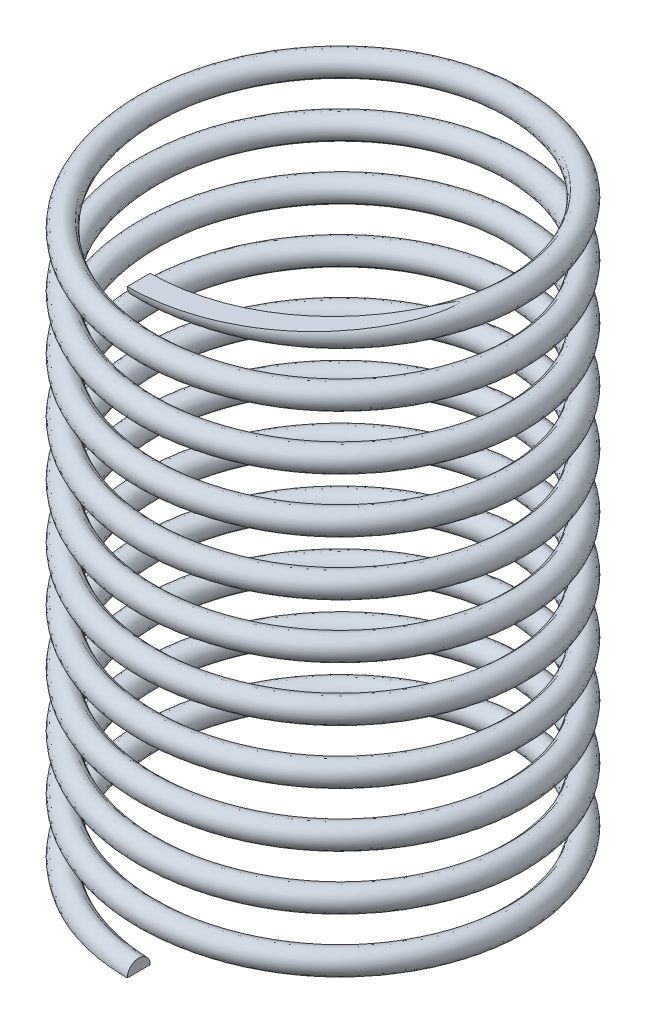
ISO-10303-21;
HEADER;
FILE_DESCRIPTION(('STEP AP214'),'2;1');
FILE_NAME('part.step','',(''),(''),'','','');
FILE_SCHEMA(('AUTOMOTIVE_DESIGN { 1 0 10303 214 1 1 1 1 }'));
ENDSEC;
DATA;
#1=APPLICATION_CONTEXT('core data for automotive mechanical design processes');
#2=APPLICATION_PROTOCOL_DEFINITION('international standard','automotive_design',2000,#1);
#3=PRODUCT_CONTEXT('',#1,'mechanical');
#4=PRODUCT('Part','Part','',(#3));
#5=PRODUCT_RELATED_PRODUCT_CATEGORY('part','',(#4));
#6=PRODUCT_DEFINITION_FORMATION('','',#4);
#7=PRODUCT_DEFINITION_CONTEXT('part definition',#1,'design');
#8=PRODUCT_DEFINITION('design','',#6,#7);
#9=PRODUCT_DEFINITION_SHAPE('','',#8);
#10=(LENGTH_UNIT() NAMED_UNIT(*) SI_UNIT(.MILLI.,.METRE.));
#11=(NAMED_UNIT(*) PLANE_ANGLE_UNIT() SI_UNIT($,.RADIAN.));
#12=(NAMED_UNIT(*) SI_UNIT($,.STERADIAN.) SOLID_ANGLE_UNIT());
#13=UNCERTAINTY_MEASURE_WITH_UNIT(LENGTH_MEASURE(1.E-05),#10,'distance_accuracy_value','');
#14=(GEOMETRIC_REPRESENTATION_CONTEXT(3) GLOBAL_UNCERTAINTY_ASSIGNED_CONTEXT((#13)) GLOBAL_UNIT_ASSIGNED_CONTEXT((#10,
#11,#12)) REPRESENTATION_CONTEXT('',''));
#15=CARTESIAN_POINT('',(0.,0.,0.));
#16=DIRECTION('',(0.,0.,1.));
#17=DIRECTION('',(1.,0.,0.));
#18=AXIS2_PLACEMENT_3D('',#15,#16,#17);
#19=CARTESIAN_POINT('',(0.,0.,2.));
#20=DIRECTION('',(1.,0.,0.));
#21=DIRECTION('',(0.,0.,-1.));
#22=AXIS2_PLACEMENT_3D('',#19,#20,#21);
#23=PLANE('',#22);
#24=DIRECTION('',(0.,0.,1.));
#25=VECTOR('',#24,1.);
#26=CARTESIAN_POINT('',(0.,0.,-5.));
#27=LINE('',#26,#25);
#28=CARTESIAN_POINT('',(0.,0.,1.875));
#29=VERTEX_POINT('',#28);
#30=CARTESIAN_POINT('',(0.,0.,2.125));
#31=VERTEX_POINT('',#30);
#32=EDGE_CURVE('E53',#29,#31,#27,.T.);
#33=ORIENTED_EDGE('',*,*,#32,.F.);
#34=CARTESIAN_POINT('',(0.,0.,2.));
#35=DIRECTION('',(1.,0.,0.));
#36=DIRECTION('',(0.,0.,-1.));
#37=AXIS2_PLACEMENT_3D('',#34,#35,#36);
#38=CIRCLE('',#37,0.125);
#39=EDGE_CURVE('E67',#29,#31,#38,.T.);
#40=ORIENTED_EDGE('',*,*,#39,.T.);
#41=EDGE_LOOP('',(#33,#40));
#42=FACE_BOUND('',#41,.T.);
#43=ADVANCED_FACE('F26',(#42),#23,.T.);
#44=CARTESIAN_POINT('',(-3.21461212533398E-13,6.5,2.));
#45=DIRECTION('',(1.,0.,1.60730606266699E-13));
#46=DIRECTION('',(1.60730606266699E-13,0.,-1.));
#47=AXIS2_PLACEMENT_3D('',#44,#45,#46);
#48=PLANE('',#47);
#49=CARTESIAN_POINT('',(-3.21461212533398E-13,6.5,2.));
#50=DIRECTION('',(1.,0.,1.60730606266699E-13));
#51=DIRECTION('',(1.60730606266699E-13,0.,-1.));
#52=AXIS2_PLACEMENT_3D('',#49,#50,#51);
#53=CIRCLE('',#52,0.125);
#54=CARTESIAN_POINT('',(-3.41552538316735E-13,6.5,2.125));
#55=VERTEX_POINT('',#54);
#56=CARTESIAN_POINT('',(-2.93333356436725E-13,6.5,1.875));
#57=VERTEX_POINT('',#56);
#58=EDGE_CURVE('E64',#55,#57,#53,.T.);
#59=ORIENTED_EDGE('',*,*,#58,.F.);
#60=DIRECTION('',(0.,0.,1.));
#61=VECTOR('',#60,1.);
#62=CARTESIAN_POINT('',(-2.93333356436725E-13,6.5,-5.));
#63=LINE('',#62,#61);
#64=EDGE_CURVE('E47',#57,#55,#63,.T.);
#65=ORIENTED_EDGE('',*,*,#64,.F.);
#66=EDGE_LOOP('',(#59,#65));
#67=FACE_BOUND('',#66,.T.);
#68=ADVANCED_FACE('F63',(#67),#48,.F.);
#69=CARTESIAN_POINT('',(0.,0.,1.875));
#70=CARTESIAN_POINT('',(-1.08253175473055,0.0492424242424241,1.875));
#71=CARTESIAN_POINT('',(-1.62379763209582,0.0984848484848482,0.9375));
#72=CARTESIAN_POINT('',(-2.1650635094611,0.147727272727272,0.));
#73=CARTESIAN_POINT('',(-1.62379763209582,0.196969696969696,-0.9375));
#74=CARTESIAN_POINT('',(-1.08253175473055,0.246212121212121,-1.875));
#75=CARTESIAN_POINT('',(0.,0.295454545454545,-1.875));
#76=CARTESIAN_POINT('',(1.08253175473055,0.344696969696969,-1.875));
#77=CARTESIAN_POINT('',(1.62379763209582,0.393939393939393,-0.937500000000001));
#78=CARTESIAN_POINT('',(2.1650635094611,0.443181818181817,0.));
#79=CARTESIAN_POINT('',(1.62379763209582,0.492424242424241,0.937499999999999));
#80=CARTESIAN_POINT('',(1.08253175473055,0.541666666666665,1.875));
#81=CARTESIAN_POINT('',(0.,0.590909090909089,1.875));
#82=CARTESIAN_POINT('',(-1.08253175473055,0.640151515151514,1.875));
#83=CARTESIAN_POINT('',(-1.62379763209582,0.689393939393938,0.9375));
#84=CARTESIAN_POINT('',(-2.1650635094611,0.738636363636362,0.));
#85=CARTESIAN_POINT('',(-1.62379763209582,0.787878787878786,-0.9375));
#86=CARTESIAN_POINT('',(-1.08253175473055,0.83712121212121,-1.875));
#87=CARTESIAN_POINT('',(0.,0.886363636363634,-1.875));
#88=CARTESIAN_POINT('',(1.08253175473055,0.935606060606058,-1.875));
#89=CARTESIAN_POINT('',(1.62379763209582,0.984848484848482,-0.937500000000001));
#90=CARTESIAN_POINT('',(2.1650635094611,1.03409090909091,0.));
#91=CARTESIAN_POINT('',(1.62379763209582,1.08333333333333,0.937499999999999));
#92=CARTESIAN_POINT('',(1.08253175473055,1.13257575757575,1.875));
#93=CARTESIAN_POINT('',(0.,1.18181818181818,1.875));
#94=CARTESIAN_POINT('',(-1.08253175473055,1.2310606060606,1.875));
#95=CARTESIAN_POINT('',(-1.62379763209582,1.28030303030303,0.9375));
#96=CARTESIAN_POINT('',(-2.1650635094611,1.32954545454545,0.));
#97=CARTESIAN_POINT('',(-1.62379763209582,1.37878787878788,-0.9375));
#98=CARTESIAN_POINT('',(-1.08253175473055,1.4280303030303,-1.875));
#99=CARTESIAN_POINT('',(0.,1.47727272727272,-1.875));
#100=CARTESIAN_POINT('',(1.08253175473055,1.52651515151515,-1.875));
#101=CARTESIAN_POINT('',(1.62379763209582,1.57575757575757,-0.937500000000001));
#102=CARTESIAN_POINT('',(2.1650635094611,1.625,0.));
#103=CARTESIAN_POINT('',(1.62379763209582,1.67424242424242,0.937499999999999));
#104=CARTESIAN_POINT('',(1.08253175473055,1.72348484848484,1.875));
#105=CARTESIAN_POINT('',(0.,1.77272727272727,1.875));
#106=CARTESIAN_POINT('',(-1.08253175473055,1.82196969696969,1.875));
#107=CARTESIAN_POINT('',(-1.62379763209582,1.87121212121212,0.9375));
#108=CARTESIAN_POINT('',(-2.1650635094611,1.92045454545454,0.));
#109=CARTESIAN_POINT('',(-1.62379763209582,1.96969696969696,-0.9375));
#110=CARTESIAN_POINT('',(-1.08253175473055,2.01893939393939,-1.875));
#111=CARTESIAN_POINT('',(0.,2.06818181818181,-1.875));
#112=CARTESIAN_POINT('',(1.08253175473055,2.11742424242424,-1.875));
#113=CARTESIAN_POINT('',(1.62379763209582,2.16666666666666,-0.937500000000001));
#114=CARTESIAN_POINT('',(2.1650635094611,2.21590909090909,0.));
#115=CARTESIAN_POINT('',(1.62379763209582,2.26515151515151,0.937499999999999));
#116=CARTESIAN_POINT('',(1.08253175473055,2.31439393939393,1.875));
#117=CARTESIAN_POINT('',(0.,2.36363636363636,1.875));
#118=CARTESIAN_POINT('',(-1.08253175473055,2.41287878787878,1.875));
#119=CARTESIAN_POINT('',(-1.62379763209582,2.46212121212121,0.9375));
#120=CARTESIAN_POINT('',(-2.1650635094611,2.51136363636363,0.));
#121=CARTESIAN_POINT('',(-1.62379763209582,2.56060606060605,-0.9375));
#122=CARTESIAN_POINT('',(-1.08253175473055,2.60984848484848,-1.875));
#123=CARTESIAN_POINT('',(0.,2.6590909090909,-1.875));
#124=CARTESIAN_POINT('',(1.08253175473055,2.70833333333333,-1.875));
#125=CARTESIAN_POINT('',(1.62379763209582,2.75757575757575,-0.937500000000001));
#126=CARTESIAN_POINT('',(2.1650635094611,2.80681818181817,0.));
#127=CARTESIAN_POINT('',(1.62379763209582,2.8560606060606,0.937499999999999));
#128=CARTESIAN_POINT('',(1.08253175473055,2.90530303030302,1.875));
#129=CARTESIAN_POINT('',(0.,2.95454545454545,1.875));
#130=CARTESIAN_POINT('',(-1.08253175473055,3.00378787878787,1.875));
#131=CARTESIAN_POINT('',(-1.62379763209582,3.0530303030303,0.9375));
#132=CARTESIAN_POINT('',(-2.1650635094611,3.10227272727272,0.));
#133=CARTESIAN_POINT('',(-1.62379763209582,3.15151515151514,-0.9375));
#134=CARTESIAN_POINT('',(-1.08253175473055,3.20075757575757,-1.875));
#135=CARTESIAN_POINT('',(0.,3.24999999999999,-1.875));
#136=CARTESIAN_POINT('',(1.08253175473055,3.29924242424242,-1.875));
#137=CARTESIAN_POINT('',(1.62379763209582,3.34848484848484,-0.937500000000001));
#138=CARTESIAN_POINT('',(2.1650635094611,3.39772727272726,0.));
#139=CARTESIAN_POINT('',(1.62379763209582,3.44696969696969,0.937499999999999));
#140=CARTESIAN_POINT('',(1.08253175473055,3.49621212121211,1.875));
#141=CARTESIAN_POINT('',(0.,3.54545454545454,1.875));
#142=CARTESIAN_POINT('',(-1.08253175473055,3.59469696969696,1.875));
#143=CARTESIAN_POINT('',(-1.62379763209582,3.64393939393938,0.9375));
#144=CARTESIAN_POINT('',(-2.1650635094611,3.69318181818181,0.));
#145=CARTESIAN_POINT('',(-1.62379763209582,3.74242424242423,-0.9375));
#146=CARTESIAN_POINT('',(-1.08253175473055,3.79166666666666,-1.875));
#147=CARTESIAN_POINT('',(0.,3.84090909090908,-1.875));
#148=CARTESIAN_POINT('',(1.08253175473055,3.89015151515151,-1.875));
#149=CARTESIAN_POINT('',(1.62379763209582,3.93939393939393,-0.937500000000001));
#150=CARTESIAN_POINT('',(2.1650635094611,3.98863636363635,0.));
#151=CARTESIAN_POINT('',(1.62379763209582,4.03787878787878,0.937499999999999));
#152=CARTESIAN_POINT('',(1.08253175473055,4.0871212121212,1.875));
#153=CARTESIAN_POINT('',(0.,4.13636363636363,1.875));
#154=CARTESIAN_POINT('',(-1.08253175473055,4.18560606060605,1.875));
#155=CARTESIAN_POINT('',(-1.62379763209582,4.23484848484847,0.9375));
#156=CARTESIAN_POINT('',(-2.1650635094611,4.2840909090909,0.));
#157=CARTESIAN_POINT('',(-1.62379763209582,4.33333333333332,-0.9375));
#158=CARTESIAN_POINT('',(-1.08253175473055,4.38257575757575,-1.875));
#159=CARTESIAN_POINT('',(0.,4.43181818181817,-1.875));
#160=CARTESIAN_POINT('',(1.08253175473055,4.48106060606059,-1.875));
#161=CARTESIAN_POINT('',(1.62379763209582,4.53030303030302,-0.937500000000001));
#162=CARTESIAN_POINT('',(2.1650635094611,4.57954545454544,0.));
#163=CARTESIAN_POINT('',(1.62379763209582,4.62878787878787,0.937499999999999));
#164=CARTESIAN_POINT('',(1.08253175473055,4.67803030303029,1.875));
#165=CARTESIAN_POINT('',(0.,4.72727272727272,1.875));
#166=CARTESIAN_POINT('',(-1.08253175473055,4.77651515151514,1.875));
#167=CARTESIAN_POINT('',(-1.62379763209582,4.82575757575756,0.9375));
#168=CARTESIAN_POINT('',(-2.1650635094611,4.87499999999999,0.));
#169=CARTESIAN_POINT('',(-1.62379763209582,4.92424242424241,-0.9375));
#170=CARTESIAN_POINT('',(-1.08253175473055,4.97348484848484,-1.875));
#171=CARTESIAN_POINT('',(0.,5.02272727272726,-1.875));
#172=CARTESIAN_POINT('',(1.08253175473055,5.07196969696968,-1.875));
#173=CARTESIAN_POINT('',(1.62379763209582,5.12121212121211,-0.937500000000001));
#174=CARTESIAN_POINT('',(2.1650635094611,5.17045454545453,0.));
#175=CARTESIAN_POINT('',(1.62379763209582,5.21969696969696,0.937499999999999));
#176=CARTESIAN_POINT('',(1.08253175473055,5.26893939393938,1.875));
#177=CARTESIAN_POINT('',(0.,5.3181818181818,1.875));
#178=CARTESIAN_POINT('',(-1.08253175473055,5.36742424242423,1.875));
#179=CARTESIAN_POINT('',(-1.62379763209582,5.41666666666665,0.9375));
#180=CARTESIAN_POINT('',(-2.1650635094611,5.46590909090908,0.));
#181=CARTESIAN_POINT('',(-1.62379763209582,5.5151515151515,-0.9375));
#182=CARTESIAN_POINT('',(-1.08253175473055,5.56439393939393,-1.875));
#183=CARTESIAN_POINT('',(0.,5.61363636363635,-1.875));
#184=CARTESIAN_POINT('',(1.08253175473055,5.66287878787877,-1.875));
#185=CARTESIAN_POINT('',(1.62379763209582,5.7121212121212,-0.937500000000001));
#186=CARTESIAN_POINT('',(2.1650635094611,5.76136363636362,0.));
#187=CARTESIAN_POINT('',(1.62379763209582,5.81060606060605,0.937499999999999));
#188=CARTESIAN_POINT('',(1.08253175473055,5.85984848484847,1.875));
#189=CARTESIAN_POINT('',(0.,5.90909090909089,1.875));
#190=CARTESIAN_POINT('',(-1.08253175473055,5.95833333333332,1.875));
#191=CARTESIAN_POINT('',(-1.62379763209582,6.00757575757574,0.9375));
#192=CARTESIAN_POINT('',(-2.1650635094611,6.05681818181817,0.));
#193=CARTESIAN_POINT('',(-1.62379763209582,6.10606060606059,-0.9375));
#194=CARTESIAN_POINT('',(-1.08253175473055,6.15530303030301,-1.875));
#195=CARTESIAN_POINT('',(0.,6.20454545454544,-1.875));
#196=CARTESIAN_POINT('',(1.08253175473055,6.25378787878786,-1.875));
#197=CARTESIAN_POINT('',(1.62379763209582,6.30303030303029,-0.937500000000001));
#198=CARTESIAN_POINT('',(2.1650635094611,6.35227272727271,0.));
#199=CARTESIAN_POINT('',(1.62379763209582,6.40151515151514,0.937499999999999));
#200=CARTESIAN_POINT('',(1.08253175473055,6.45075757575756,1.875));
#201=CARTESIAN_POINT('',(0.,6.49999999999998,1.875));
#202=CARTESIAN_POINT('',(-1.08253175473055,6.54924242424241,1.875));
#203=CARTESIAN_POINT('',(-1.62379763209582,6.59848484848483,0.9375));
#204=CARTESIAN_POINT('',(-2.1650635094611,6.64772727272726,0.));
#205=CARTESIAN_POINT('',(-1.62379763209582,6.69696969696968,-0.9375));
#206=CARTESIAN_POINT('',(-1.08253175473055,6.7462121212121,-1.875));
#207=CARTESIAN_POINT('',(0.,6.79545454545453,-1.875));
#208=CARTESIAN_POINT('',(1.08253175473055,6.84469696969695,-1.875));
#209=CARTESIAN_POINT('',(1.62379763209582,6.89393939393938,-0.937500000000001));
#210=CARTESIAN_POINT('',(2.1650635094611,6.9431818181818,0.));
#211=CARTESIAN_POINT('',(1.62379763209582,6.99242424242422,0.937499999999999));
#212=CARTESIAN_POINT('',(1.08253175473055,7.04166666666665,1.875));
#213=CARTESIAN_POINT('',(0.,7.09090909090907,1.875));
#214=CARTESIAN_POINT('',(0.,0.25,1.875));
#215=CARTESIAN_POINT('',(-1.08253175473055,0.299242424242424,1.875));
#216=CARTESIAN_POINT('',(-1.62379763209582,0.348484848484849,0.9375));
#217=CARTESIAN_POINT('',(-2.1650635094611,0.397727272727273,0.));
#218=CARTESIAN_POINT('',(-1.62379763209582,0.446969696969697,-0.937499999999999));
#219=CARTESIAN_POINT('',(-1.08253175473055,0.496212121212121,-1.875));
#220=CARTESIAN_POINT('',(0.,0.545454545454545,-1.875));
#221=CARTESIAN_POINT('',(1.08253175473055,0.594696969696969,-1.875));
#222=CARTESIAN_POINT('',(1.62379763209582,0.643939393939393,-0.937500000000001));
#223=CARTESIAN_POINT('',(2.1650635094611,0.693181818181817,0.));
#224=CARTESIAN_POINT('',(1.62379763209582,0.742424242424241,0.937499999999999));
#225=CARTESIAN_POINT('',(1.08253175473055,0.791666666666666,1.875));
#226=CARTESIAN_POINT('',(0.,0.84090909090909,1.875));
#227=CARTESIAN_POINT('',(-1.08253175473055,0.890151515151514,1.875));
#228=CARTESIAN_POINT('',(-1.62379763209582,0.939393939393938,0.9375));
#229=CARTESIAN_POINT('',(-2.1650635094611,0.988636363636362,0.));
#230=CARTESIAN_POINT('',(-1.62379763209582,1.03787878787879,-0.937499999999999));
#231=CARTESIAN_POINT('',(-1.08253175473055,1.08712121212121,-1.875));
#232=CARTESIAN_POINT('',(0.,1.13636363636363,-1.875));
#233=CARTESIAN_POINT('',(1.08253175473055,1.18560606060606,-1.875));
#234=CARTESIAN_POINT('',(1.62379763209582,1.23484848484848,-0.937500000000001));
#235=CARTESIAN_POINT('',(2.1650635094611,1.28409090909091,0.));
#236=CARTESIAN_POINT('',(1.62379763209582,1.33333333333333,0.937499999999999));
#237=CARTESIAN_POINT('',(1.08253175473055,1.38257575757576,1.875));
#238=CARTESIAN_POINT('',(0.,1.43181818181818,1.875));
#239=CARTESIAN_POINT('',(-1.08253175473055,1.4810606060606,1.875));
#240=CARTESIAN_POINT('',(-1.62379763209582,1.53030303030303,0.9375));
#241=CARTESIAN_POINT('',(-2.1650635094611,1.57954545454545,0.));
#242=CARTESIAN_POINT('',(-1.62379763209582,1.62878787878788,-0.937499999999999));
#243=CARTESIAN_POINT('',(-1.08253175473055,1.6780303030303,-1.875));
#244=CARTESIAN_POINT('',(0.,1.72727272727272,-1.875));
#245=CARTESIAN_POINT('',(1.08253175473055,1.77651515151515,-1.875));
#246=CARTESIAN_POINT('',(1.62379763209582,1.82575757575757,-0.937500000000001));
#247=CARTESIAN_POINT('',(2.1650635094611,1.875,0.));
#248=CARTESIAN_POINT('',(1.62379763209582,1.92424242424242,0.937499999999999));
#249=CARTESIAN_POINT('',(1.08253175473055,1.97348484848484,1.875));
#250=CARTESIAN_POINT('',(0.,2.02272727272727,1.875));
#251=CARTESIAN_POINT('',(-1.08253175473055,2.07196969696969,1.875));
#252=CARTESIAN_POINT('',(-1.62379763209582,2.12121212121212,0.9375));
#253=CARTESIAN_POINT('',(-2.1650635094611,2.17045454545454,0.));
#254=CARTESIAN_POINT('',(-1.62379763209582,2.21969696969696,-0.937499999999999));
#255=CARTESIAN_POINT('',(-1.08253175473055,2.26893939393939,-1.875));
#256=CARTESIAN_POINT('',(0.,2.31818181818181,-1.875));
#257=CARTESIAN_POINT('',(1.08253175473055,2.36742424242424,-1.875));
#258=CARTESIAN_POINT('',(1.62379763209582,2.41666666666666,-0.937500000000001));
#259=CARTESIAN_POINT('',(2.1650635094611,2.46590909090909,0.));
#260=CARTESIAN_POINT('',(1.62379763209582,2.51515151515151,0.937499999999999));
#261=CARTESIAN_POINT('',(1.08253175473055,2.56439393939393,1.875));
#262=CARTESIAN_POINT('',(0.,2.61363636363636,1.875));
#263=CARTESIAN_POINT('',(-1.08253175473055,2.66287878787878,1.875));
#264=CARTESIAN_POINT('',(-1.62379763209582,2.71212121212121,0.9375));
#265=CARTESIAN_POINT('',(-2.1650635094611,2.76136363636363,0.));
#266=CARTESIAN_POINT('',(-1.62379763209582,2.81060606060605,-0.937499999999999));
#267=CARTESIAN_POINT('',(-1.08253175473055,2.85984848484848,-1.875));
#268=CARTESIAN_POINT('',(0.,2.9090909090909,-1.875));
#269=CARTESIAN_POINT('',(1.08253175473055,2.95833333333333,-1.875));
#270=CARTESIAN_POINT('',(1.62379763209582,3.00757575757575,-0.937500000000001));
#271=CARTESIAN_POINT('',(2.1650635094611,3.05681818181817,0.));
#272=CARTESIAN_POINT('',(1.62379763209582,3.1060606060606,0.937499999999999));
#273=CARTESIAN_POINT('',(1.08253175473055,3.15530303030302,1.875));
#274=CARTESIAN_POINT('',(0.,3.20454545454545,1.875));
#275=CARTESIAN_POINT('',(-1.08253175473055,3.25378787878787,1.875));
#276=CARTESIAN_POINT('',(-1.62379763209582,3.3030303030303,0.9375));
#277=CARTESIAN_POINT('',(-2.1650635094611,3.35227272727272,0.));
#278=CARTESIAN_POINT('',(-1.62379763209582,3.40151515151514,-0.937499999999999));
#279=CARTESIAN_POINT('',(-1.08253175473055,3.45075757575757,-1.875));
#280=CARTESIAN_POINT('',(0.,3.49999999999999,-1.875));
#281=CARTESIAN_POINT('',(1.08253175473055,3.54924242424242,-1.875));
#282=CARTESIAN_POINT('',(1.62379763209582,3.59848484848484,-0.937500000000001));
#283=CARTESIAN_POINT('',(2.1650635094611,3.64772727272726,0.));
#284=CARTESIAN_POINT('',(1.62379763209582,3.69696969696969,0.937499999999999));
#285=CARTESIAN_POINT('',(1.08253175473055,3.74621212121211,1.875));
#286=CARTESIAN_POINT('',(0.,3.79545454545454,1.875));
#287=CARTESIAN_POINT('',(-1.08253175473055,3.84469696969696,1.875));
#288=CARTESIAN_POINT('',(-1.62379763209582,3.89393939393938,0.9375));
#289=CARTESIAN_POINT('',(-2.1650635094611,3.94318181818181,0.));
#290=CARTESIAN_POINT('',(-1.62379763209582,3.99242424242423,-0.937499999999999));
#291=CARTESIAN_POINT('',(-1.08253175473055,4.04166666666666,-1.875));
#292=CARTESIAN_POINT('',(0.,4.09090909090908,-1.875));
#293=CARTESIAN_POINT('',(1.08253175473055,4.14015151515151,-1.875));
#294=CARTESIAN_POINT('',(1.62379763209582,4.18939393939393,-0.937500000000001));
#295=CARTESIAN_POINT('',(2.1650635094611,4.23863636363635,0.));
#296=CARTESIAN_POINT('',(1.62379763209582,4.28787878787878,0.937499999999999));
#297=CARTESIAN_POINT('',(1.08253175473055,4.3371212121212,1.875));
#298=CARTESIAN_POINT('',(0.,4.38636363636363,1.875));
#299=CARTESIAN_POINT('',(-1.08253175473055,4.43560606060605,1.875));
#300=CARTESIAN_POINT('',(-1.62379763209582,4.48484848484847,0.9375));
#301=CARTESIAN_POINT('',(-2.1650635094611,4.5340909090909,0.));
#302=CARTESIAN_POINT('',(-1.62379763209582,4.58333333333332,-0.937499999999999));
#303=CARTESIAN_POINT('',(-1.08253175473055,4.63257575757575,-1.875));
#304=CARTESIAN_POINT('',(0.,4.68181818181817,-1.875));
#305=CARTESIAN_POINT('',(1.08253175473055,4.73106060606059,-1.875));
#306=CARTESIAN_POINT('',(1.62379763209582,4.78030303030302,-0.937500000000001));
#307=CARTESIAN_POINT('',(2.1650635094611,4.82954545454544,0.));
#308=CARTESIAN_POINT('',(1.62379763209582,4.87878787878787,0.937499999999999));
#309=CARTESIAN_POINT('',(1.08253175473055,4.92803030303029,1.875));
#310=CARTESIAN_POINT('',(0.,4.97727272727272,1.875));
#311=CARTESIAN_POINT('',(-1.08253175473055,5.02651515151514,1.875));
#312=CARTESIAN_POINT('',(-1.62379763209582,5.07575757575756,0.9375));
#313=CARTESIAN_POINT('',(-2.1650635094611,5.12499999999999,0.));
#314=CARTESIAN_POINT('',(-1.62379763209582,5.17424242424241,-0.937499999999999));
#315=CARTESIAN_POINT('',(-1.08253175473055,5.22348484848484,-1.875));
#316=CARTESIAN_POINT('',(0.,5.27272727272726,-1.875));
#317=CARTESIAN_POINT('',(1.08253175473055,5.32196969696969,-1.875));
#318=CARTESIAN_POINT('',(1.62379763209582,5.37121212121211,-0.937500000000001));
#319=CARTESIAN_POINT('',(2.1650635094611,5.42045454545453,0.));
#320=CARTESIAN_POINT('',(1.62379763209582,5.46969696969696,0.937499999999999));
#321=CARTESIAN_POINT('',(1.08253175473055,5.51893939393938,1.875));
#322=CARTESIAN_POINT('',(0.,5.56818181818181,1.875));
#323=CARTESIAN_POINT('',(-1.08253175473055,5.61742424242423,1.875));
#324=CARTESIAN_POINT('',(-1.62379763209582,5.66666666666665,0.9375));
#325=CARTESIAN_POINT('',(-2.1650635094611,5.71590909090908,0.));
#326=CARTESIAN_POINT('',(-1.62379763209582,5.7651515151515,-0.937499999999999));
#327=CARTESIAN_POINT('',(-1.08253175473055,5.81439393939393,-1.875));
#328=CARTESIAN_POINT('',(0.,5.86363636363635,-1.875));
#329=CARTESIAN_POINT('',(1.08253175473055,5.91287878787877,-1.875));
#330=CARTESIAN_POINT('',(1.62379763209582,5.9621212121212,-0.937500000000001));
#331=CARTESIAN_POINT('',(2.1650635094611,6.01136363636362,0.));
#332=CARTESIAN_POINT('',(1.62379763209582,6.06060606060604,0.937499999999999));
#333=CARTESIAN_POINT('',(1.08253175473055,6.10984848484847,1.875));
#334=CARTESIAN_POINT('',(0.,6.15909090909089,1.875));
#335=CARTESIAN_POINT('',(-1.08253175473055,6.20833333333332,1.875));
#336=CARTESIAN_POINT('',(-1.62379763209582,6.25757575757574,0.9375));
#337=CARTESIAN_POINT('',(-2.1650635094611,6.30681818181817,0.));
#338=CARTESIAN_POINT('',(-1.62379763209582,6.35606060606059,-0.937499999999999));
#339=CARTESIAN_POINT('',(-1.08253175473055,6.40530303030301,-1.875));
#340=CARTESIAN_POINT('',(0.,6.45454545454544,-1.875));
#341=CARTESIAN_POINT('',(1.08253175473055,6.50378787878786,-1.875));
#342=CARTESIAN_POINT('',(1.62379763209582,6.55303030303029,-0.937500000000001));
#343=CARTESIAN_POINT('',(2.1650635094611,6.60227272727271,0.));
#344=CARTESIAN_POINT('',(1.62379763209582,6.65151515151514,0.937499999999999));
#345=CARTESIAN_POINT('',(1.08253175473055,6.70075757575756,1.875));
#346=CARTESIAN_POINT('',(0.,6.74999999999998,1.875));
#347=CARTESIAN_POINT('',(-1.08253175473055,6.79924242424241,1.875));
#348=CARTESIAN_POINT('',(-1.62379763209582,6.84848484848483,0.9375));
#349=CARTESIAN_POINT('',(-2.1650635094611,6.89772727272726,0.));
#350=CARTESIAN_POINT('',(-1.62379763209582,6.94696969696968,-0.937499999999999));
#351=CARTESIAN_POINT('',(-1.08253175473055,6.9962121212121,-1.875));
#352=CARTESIAN_POINT('',(0.,7.04545454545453,-1.875));
#353=CARTESIAN_POINT('',(1.08253175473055,7.09469696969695,-1.875));
#354=CARTESIAN_POINT('',(1.62379763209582,7.14393939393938,-0.937500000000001));
#355=CARTESIAN_POINT('',(2.1650635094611,7.1931818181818,0.));
#356=CARTESIAN_POINT('',(1.62379763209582,7.24242424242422,0.937499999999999));
#357=CARTESIAN_POINT('',(1.08253175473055,7.29166666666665,1.875));
#358=CARTESIAN_POINT('',(0.,7.34090909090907,1.875));
#359=CARTESIAN_POINT('',(0.,0.25,2.125));
#360=CARTESIAN_POINT('',(-1.22686932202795,0.299242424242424,2.125));
#361=CARTESIAN_POINT('',(-1.84030398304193,0.348484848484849,1.0625));
#362=CARTESIAN_POINT('',(-2.45373864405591,0.397727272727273,0.));
#363=CARTESIAN_POINT('',(-1.84030398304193,0.446969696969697,-1.0625));
#364=CARTESIAN_POINT('',(-1.22686932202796,0.496212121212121,-2.125));
#365=CARTESIAN_POINT('',(0.,0.545454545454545,-2.125));
#366=CARTESIAN_POINT('',(1.22686932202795,0.594696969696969,-2.125));
#367=CARTESIAN_POINT('',(1.84030398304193,0.643939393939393,-1.0625));
#368=CARTESIAN_POINT('',(2.45373864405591,0.693181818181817,0.));
#369=CARTESIAN_POINT('',(1.84030398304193,0.742424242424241,1.0625));
#370=CARTESIAN_POINT('',(1.22686932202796,0.791666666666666,2.125));
#371=CARTESIAN_POINT('',(0.,0.84090909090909,2.125));
#372=CARTESIAN_POINT('',(-1.22686932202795,0.890151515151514,2.125));
#373=CARTESIAN_POINT('',(-1.84030398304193,0.939393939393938,1.0625));
#374=CARTESIAN_POINT('',(-2.45373864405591,0.988636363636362,0.));
#375=CARTESIAN_POINT('',(-1.84030398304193,1.03787878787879,-1.0625));
#376=CARTESIAN_POINT('',(-1.22686932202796,1.08712121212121,-2.125));
#377=CARTESIAN_POINT('',(0.,1.13636363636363,-2.125));
#378=CARTESIAN_POINT('',(1.22686932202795,1.18560606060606,-2.125));
#379=CARTESIAN_POINT('',(1.84030398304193,1.23484848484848,-1.0625));
#380=CARTESIAN_POINT('',(2.45373864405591,1.28409090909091,0.));
#381=CARTESIAN_POINT('',(1.84030398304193,1.33333333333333,1.0625));
#382=CARTESIAN_POINT('',(1.22686932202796,1.38257575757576,2.125));
#383=CARTESIAN_POINT('',(0.,1.43181818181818,2.125));
#384=CARTESIAN_POINT('',(-1.22686932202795,1.4810606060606,2.125));
#385=CARTESIAN_POINT('',(-1.84030398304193,1.53030303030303,1.0625));
#386=CARTESIAN_POINT('',(-2.45373864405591,1.57954545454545,0.));
#387=CARTESIAN_POINT('',(-1.84030398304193,1.62878787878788,-1.0625));
#388=CARTESIAN_POINT('',(-1.22686932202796,1.6780303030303,-2.125));
#389=CARTESIAN_POINT('',(0.,1.72727272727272,-2.125));
#390=CARTESIAN_POINT('',(1.22686932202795,1.77651515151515,-2.125));
#391=CARTESIAN_POINT('',(1.84030398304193,1.82575757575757,-1.0625));
#392=CARTESIAN_POINT('',(2.45373864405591,1.875,0.));
#393=CARTESIAN_POINT('',(1.84030398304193,1.92424242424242,1.0625));
#394=CARTESIAN_POINT('',(1.22686932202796,1.97348484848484,2.125));
#395=CARTESIAN_POINT('',(0.,2.02272727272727,2.125));
#396=CARTESIAN_POINT('',(-1.22686932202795,2.07196969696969,2.125));
#397=CARTESIAN_POINT('',(-1.84030398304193,2.12121212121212,1.0625));
#398=CARTESIAN_POINT('',(-2.45373864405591,2.17045454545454,0.));
#399=CARTESIAN_POINT('',(-1.84030398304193,2.21969696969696,-1.0625));
#400=CARTESIAN_POINT('',(-1.22686932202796,2.26893939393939,-2.125));
#401=CARTESIAN_POINT('',(0.,2.31818181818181,-2.125));
#402=CARTESIAN_POINT('',(1.22686932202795,2.36742424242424,-2.125));
#403=CARTESIAN_POINT('',(1.84030398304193,2.41666666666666,-1.0625));
#404=CARTESIAN_POINT('',(2.45373864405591,2.46590909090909,0.));
#405=CARTESIAN_POINT('',(1.84030398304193,2.51515151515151,1.0625));
#406=CARTESIAN_POINT('',(1.22686932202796,2.56439393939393,2.125));
#407=CARTESIAN_POINT('',(0.,2.61363636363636,2.125));
#408=CARTESIAN_POINT('',(-1.22686932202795,2.66287878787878,2.125));
#409=CARTESIAN_POINT('',(-1.84030398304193,2.71212121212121,1.0625));
#410=CARTESIAN_POINT('',(-2.45373864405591,2.76136363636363,0.));
#411=CARTESIAN_POINT('',(-1.84030398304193,2.81060606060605,-1.0625));
#412=CARTESIAN_POINT('',(-1.22686932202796,2.85984848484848,-2.125));
#413=CARTESIAN_POINT('',(0.,2.9090909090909,-2.125));
#414=CARTESIAN_POINT('',(1.22686932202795,2.95833333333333,-2.125));
#415=CARTESIAN_POINT('',(1.84030398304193,3.00757575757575,-1.0625));
#416=CARTESIAN_POINT('',(2.45373864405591,3.05681818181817,0.));
#417=CARTESIAN_POINT('',(1.84030398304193,3.1060606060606,1.0625));
#418=CARTESIAN_POINT('',(1.22686932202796,3.15530303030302,2.125));
#419=CARTESIAN_POINT('',(0.,3.20454545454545,2.125));
#420=CARTESIAN_POINT('',(-1.22686932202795,3.25378787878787,2.125));
#421=CARTESIAN_POINT('',(-1.84030398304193,3.3030303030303,1.0625));
#422=CARTESIAN_POINT('',(-2.45373864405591,3.35227272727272,0.));
#423=CARTESIAN_POINT('',(-1.84030398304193,3.40151515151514,-1.0625));
#424=CARTESIAN_POINT('',(-1.22686932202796,3.45075757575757,-2.125));
#425=CARTESIAN_POINT('',(0.,3.49999999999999,-2.125));
#426=CARTESIAN_POINT('',(1.22686932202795,3.54924242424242,-2.125));
#427=CARTESIAN_POINT('',(1.84030398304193,3.59848484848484,-1.0625));
#428=CARTESIAN_POINT('',(2.45373864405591,3.64772727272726,0.));
#429=CARTESIAN_POINT('',(1.84030398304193,3.69696969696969,1.0625));
#430=CARTESIAN_POINT('',(1.22686932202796,3.74621212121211,2.125));
#431=CARTESIAN_POINT('',(0.,3.79545454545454,2.125));
#432=CARTESIAN_POINT('',(-1.22686932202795,3.84469696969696,2.125));
#433=CARTESIAN_POINT('',(-1.84030398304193,3.89393939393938,1.0625));
#434=CARTESIAN_POINT('',(-2.45373864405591,3.94318181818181,0.));
#435=CARTESIAN_POINT('',(-1.84030398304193,3.99242424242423,-1.0625));
#436=CARTESIAN_POINT('',(-1.22686932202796,4.04166666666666,-2.125));
#437=CARTESIAN_POINT('',(0.,4.09090909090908,-2.125));
#438=CARTESIAN_POINT('',(1.22686932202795,4.14015151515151,-2.125));
#439=CARTESIAN_POINT('',(1.84030398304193,4.18939393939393,-1.0625));
#440=CARTESIAN_POINT('',(2.45373864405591,4.23863636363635,0.));
#441=CARTESIAN_POINT('',(1.84030398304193,4.28787878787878,1.0625));
#442=CARTESIAN_POINT('',(1.22686932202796,4.3371212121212,2.125));
#443=CARTESIAN_POINT('',(0.,4.38636363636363,2.125));
#444=CARTESIAN_POINT('',(-1.22686932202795,4.43560606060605,2.125));
#445=CARTESIAN_POINT('',(-1.84030398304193,4.48484848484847,1.0625));
#446=CARTESIAN_POINT('',(-2.45373864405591,4.5340909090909,0.));
#447=CARTESIAN_POINT('',(-1.84030398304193,4.58333333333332,-1.0625));
#448=CARTESIAN_POINT('',(-1.22686932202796,4.63257575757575,-2.125));
#449=CARTESIAN_POINT('',(0.,4.68181818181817,-2.125));
#450=CARTESIAN_POINT('',(1.22686932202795,4.73106060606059,-2.125));
#451=CARTESIAN_POINT('',(1.84030398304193,4.78030303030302,-1.0625));
#452=CARTESIAN_POINT('',(2.45373864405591,4.82954545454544,0.));
#453=CARTESIAN_POINT('',(1.84030398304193,4.87878787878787,1.0625));
#454=CARTESIAN_POINT('',(1.22686932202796,4.92803030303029,2.125));
#455=CARTESIAN_POINT('',(0.,4.97727272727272,2.125));
#456=CARTESIAN_POINT('',(-1.22686932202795,5.02651515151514,2.125));
#457=CARTESIAN_POINT('',(-1.84030398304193,5.07575757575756,1.0625));
#458=CARTESIAN_POINT('',(-2.45373864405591,5.12499999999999,0.));
#459=CARTESIAN_POINT('',(-1.84030398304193,5.17424242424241,-1.0625));
#460=CARTESIAN_POINT('',(-1.22686932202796,5.22348484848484,-2.125));
#461=CARTESIAN_POINT('',(0.,5.27272727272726,-2.125));
#462=CARTESIAN_POINT('',(1.22686932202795,5.32196969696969,-2.125));
#463=CARTESIAN_POINT('',(1.84030398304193,5.37121212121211,-1.0625));
#464=CARTESIAN_POINT('',(2.45373864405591,5.42045454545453,0.));
#465=CARTESIAN_POINT('',(1.84030398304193,5.46969696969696,1.0625));
#466=CARTESIAN_POINT('',(1.22686932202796,5.51893939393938,2.125));
#467=CARTESIAN_POINT('',(0.,5.56818181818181,2.125));
#468=CARTESIAN_POINT('',(-1.22686932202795,5.61742424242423,2.125));
#469=CARTESIAN_POINT('',(-1.84030398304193,5.66666666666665,1.0625));
#470=CARTESIAN_POINT('',(-2.45373864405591,5.71590909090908,0.));
#471=CARTESIAN_POINT('',(-1.84030398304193,5.7651515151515,-1.0625));
#472=CARTESIAN_POINT('',(-1.22686932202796,5.81439393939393,-2.125));
#473=CARTESIAN_POINT('',(0.,5.86363636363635,-2.125));
#474=CARTESIAN_POINT('',(1.22686932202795,5.91287878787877,-2.125));
#475=CARTESIAN_POINT('',(1.84030398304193,5.9621212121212,-1.0625));
#476=CARTESIAN_POINT('',(2.45373864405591,6.01136363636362,0.));
#477=CARTESIAN_POINT('',(1.84030398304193,6.06060606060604,1.0625));
#478=CARTESIAN_POINT('',(1.22686932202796,6.10984848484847,2.125));
#479=CARTESIAN_POINT('',(0.,6.15909090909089,2.125));
#480=CARTESIAN_POINT('',(-1.22686932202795,6.20833333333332,2.125));
#481=CARTESIAN_POINT('',(-1.84030398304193,6.25757575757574,1.0625));
#482=CARTESIAN_POINT('',(-2.45373864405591,6.30681818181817,0.));
#483=CARTESIAN_POINT('',(-1.84030398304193,6.35606060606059,-1.0625));
#484=CARTESIAN_POINT('',(-1.22686932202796,6.40530303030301,-2.125));
#485=CARTESIAN_POINT('',(0.,6.45454545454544,-2.125));
#486=CARTESIAN_POINT('',(1.22686932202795,6.50378787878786,-2.125));
#487=CARTESIAN_POINT('',(1.84030398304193,6.55303030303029,-1.0625));
#488=CARTESIAN_POINT('',(2.45373864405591,6.60227272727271,0.));
#489=CARTESIAN_POINT('',(1.84030398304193,6.65151515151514,1.0625));
#490=CARTESIAN_POINT('',(1.22686932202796,6.70075757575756,2.125));
#491=CARTESIAN_POINT('',(0.,6.74999999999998,2.125));
#492=CARTESIAN_POINT('',(-1.22686932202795,6.79924242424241,2.125));
#493=CARTESIAN_POINT('',(-1.84030398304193,6.84848484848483,1.0625));
#494=CARTESIAN_POINT('',(-2.45373864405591,6.89772727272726,0.));
#495=CARTESIAN_POINT('',(-1.84030398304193,6.94696969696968,-1.0625));
#496=CARTESIAN_POINT('',(-1.22686932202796,6.9962121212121,-2.125));
#497=CARTESIAN_POINT('',(0.,7.04545454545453,-2.125));
#498=CARTESIAN_POINT('',(1.22686932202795,7.09469696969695,-2.125));
#499=CARTESIAN_POINT('',(1.84030398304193,7.14393939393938,-1.0625));
#500=CARTESIAN_POINT('',(2.45373864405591,7.1931818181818,0.));
#501=CARTESIAN_POINT('',(1.84030398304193,7.24242424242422,1.0625));
#502=CARTESIAN_POINT('',(1.22686932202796,7.29166666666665,2.125));
#503=CARTESIAN_POINT('',(0.,7.34090909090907,2.125));
#504=CARTESIAN_POINT('',(0.,0.,2.125));
#505=CARTESIAN_POINT('',(-1.22686932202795,0.0492424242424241,2.125));
#506=CARTESIAN_POINT('',(-1.84030398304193,0.0984848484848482,1.0625));
#507=CARTESIAN_POINT('',(-2.45373864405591,0.147727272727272,0.));
#508=CARTESIAN_POINT('',(-1.84030398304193,0.196969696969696,-1.0625));
#509=CARTESIAN_POINT('',(-1.22686932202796,0.246212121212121,-2.125));
#510=CARTESIAN_POINT('',(0.,0.295454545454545,-2.125));
#511=CARTESIAN_POINT('',(1.22686932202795,0.344696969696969,-2.125));
#512=CARTESIAN_POINT('',(1.84030398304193,0.393939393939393,-1.0625));
#513=CARTESIAN_POINT('',(2.45373864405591,0.443181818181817,0.));
#514=CARTESIAN_POINT('',(1.84030398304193,0.492424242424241,1.0625));
#515=CARTESIAN_POINT('',(1.22686932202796,0.541666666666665,2.125));
#516=CARTESIAN_POINT('',(0.,0.590909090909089,2.125));
#517=CARTESIAN_POINT('',(-1.22686932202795,0.640151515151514,2.125));
#518=CARTESIAN_POINT('',(-1.84030398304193,0.689393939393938,1.0625));
#519=CARTESIAN_POINT('',(-2.45373864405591,0.738636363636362,0.));
#520=CARTESIAN_POINT('',(-1.84030398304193,0.787878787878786,-1.0625));
#521=CARTESIAN_POINT('',(-1.22686932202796,0.83712121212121,-2.125));
#522=CARTESIAN_POINT('',(0.,0.886363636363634,-2.125));
#523=CARTESIAN_POINT('',(1.22686932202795,0.935606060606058,-2.125));
#524=CARTESIAN_POINT('',(1.84030398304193,0.984848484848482,-1.0625));
#525=CARTESIAN_POINT('',(2.45373864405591,1.03409090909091,0.));
#526=CARTESIAN_POINT('',(1.84030398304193,1.08333333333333,1.0625));
#527=CARTESIAN_POINT('',(1.22686932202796,1.13257575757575,2.125));
#528=CARTESIAN_POINT('',(0.,1.18181818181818,2.125));
#529=CARTESIAN_POINT('',(-1.22686932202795,1.2310606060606,2.125));
#530=CARTESIAN_POINT('',(-1.84030398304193,1.28030303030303,1.0625));
#531=CARTESIAN_POINT('',(-2.45373864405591,1.32954545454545,0.));
#532=CARTESIAN_POINT('',(-1.84030398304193,1.37878787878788,-1.0625));
#533=CARTESIAN_POINT('',(-1.22686932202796,1.4280303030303,-2.125));
#534=CARTESIAN_POINT('',(0.,1.47727272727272,-2.125));
#535=CARTESIAN_POINT('',(1.22686932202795,1.52651515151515,-2.125));
#536=CARTESIAN_POINT('',(1.84030398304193,1.57575757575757,-1.0625));
#537=CARTESIAN_POINT('',(2.45373864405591,1.625,0.));
#538=CARTESIAN_POINT('',(1.84030398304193,1.67424242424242,1.0625));
#539=CARTESIAN_POINT('',(1.22686932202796,1.72348484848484,2.125));
#540=CARTESIAN_POINT('',(0.,1.77272727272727,2.125));
#541=CARTESIAN_POINT('',(-1.22686932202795,1.82196969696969,2.125));
#542=CARTESIAN_POINT('',(-1.84030398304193,1.87121212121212,1.0625));
#543=CARTESIAN_POINT('',(-2.45373864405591,1.92045454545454,0.));
#544=CARTESIAN_POINT('',(-1.84030398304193,1.96969696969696,-1.0625));
#545=CARTESIAN_POINT('',(-1.22686932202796,2.01893939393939,-2.125));
#546=CARTESIAN_POINT('',(0.,2.06818181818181,-2.125));
#547=CARTESIAN_POINT('',(1.22686932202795,2.11742424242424,-2.125));
#548=CARTESIAN_POINT('',(1.84030398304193,2.16666666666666,-1.0625));
#549=CARTESIAN_POINT('',(2.45373864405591,2.21590909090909,0.));
#550=CARTESIAN_POINT('',(1.84030398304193,2.26515151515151,1.0625));
#551=CARTESIAN_POINT('',(1.22686932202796,2.31439393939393,2.125));
#552=CARTESIAN_POINT('',(0.,2.36363636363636,2.125));
#553=CARTESIAN_POINT('',(-1.22686932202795,2.41287878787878,2.125));
#554=CARTESIAN_POINT('',(-1.84030398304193,2.46212121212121,1.0625));
#555=CARTESIAN_POINT('',(-2.45373864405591,2.51136363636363,0.));
#556=CARTESIAN_POINT('',(-1.84030398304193,2.56060606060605,-1.0625));
#557=CARTESIAN_POINT('',(-1.22686932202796,2.60984848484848,-2.125));
#558=CARTESIAN_POINT('',(0.,2.6590909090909,-2.125));
#559=CARTESIAN_POINT('',(1.22686932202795,2.70833333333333,-2.125));
#560=CARTESIAN_POINT('',(1.84030398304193,2.75757575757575,-1.0625));
#561=CARTESIAN_POINT('',(2.45373864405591,2.80681818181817,0.));
#562=CARTESIAN_POINT('',(1.84030398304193,2.8560606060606,1.0625));
#563=CARTESIAN_POINT('',(1.22686932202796,2.90530303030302,2.125));
#564=CARTESIAN_POINT('',(0.,2.95454545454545,2.125));
#565=CARTESIAN_POINT('',(-1.22686932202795,3.00378787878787,2.125));
#566=CARTESIAN_POINT('',(-1.84030398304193,3.0530303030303,1.0625));
#567=CARTESIAN_POINT('',(-2.45373864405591,3.10227272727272,0.));
#568=CARTESIAN_POINT('',(-1.84030398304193,3.15151515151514,-1.0625));
#569=CARTESIAN_POINT('',(-1.22686932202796,3.20075757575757,-2.125));
#570=CARTESIAN_POINT('',(0.,3.24999999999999,-2.125));
#571=CARTESIAN_POINT('',(1.22686932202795,3.29924242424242,-2.125));
#572=CARTESIAN_POINT('',(1.84030398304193,3.34848484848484,-1.0625));
#573=CARTESIAN_POINT('',(2.45373864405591,3.39772727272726,0.));
#574=CARTESIAN_POINT('',(1.84030398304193,3.44696969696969,1.0625));
#575=CARTESIAN_POINT('',(1.22686932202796,3.49621212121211,2.125));
#576=CARTESIAN_POINT('',(0.,3.54545454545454,2.125));
#577=CARTESIAN_POINT('',(-1.22686932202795,3.59469696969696,2.125));
#578=CARTESIAN_POINT('',(-1.84030398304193,3.64393939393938,1.0625));
#579=CARTESIAN_POINT('',(-2.45373864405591,3.69318181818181,0.));
#580=CARTESIAN_POINT('',(-1.84030398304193,3.74242424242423,-1.0625));
#581=CARTESIAN_POINT('',(-1.22686932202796,3.79166666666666,-2.125));
#582=CARTESIAN_POINT('',(0.,3.84090909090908,-2.125));
#583=CARTESIAN_POINT('',(1.22686932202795,3.89015151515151,-2.125));
#584=CARTESIAN_POINT('',(1.84030398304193,3.93939393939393,-1.0625));
#585=CARTESIAN_POINT('',(2.45373864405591,3.98863636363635,0.));
#586=CARTESIAN_POINT('',(1.84030398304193,4.03787878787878,1.0625));
#587=CARTESIAN_POINT('',(1.22686932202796,4.0871212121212,2.125));
#588=CARTESIAN_POINT('',(0.,4.13636363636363,2.125));
#589=CARTESIAN_POINT('',(-1.22686932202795,4.18560606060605,2.125));
#590=CARTESIAN_POINT('',(-1.84030398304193,4.23484848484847,1.0625));
#591=CARTESIAN_POINT('',(-2.45373864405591,4.2840909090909,0.));
#592=CARTESIAN_POINT('',(-1.84030398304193,4.33333333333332,-1.0625));
#593=CARTESIAN_POINT('',(-1.22686932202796,4.38257575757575,-2.125));
#594=CARTESIAN_POINT('',(0.,4.43181818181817,-2.125));
#595=CARTESIAN_POINT('',(1.22686932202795,4.48106060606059,-2.125));
#596=CARTESIAN_POINT('',(1.84030398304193,4.53030303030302,-1.0625));
#597=CARTESIAN_POINT('',(2.45373864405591,4.57954545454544,0.));
#598=CARTESIAN_POINT('',(1.84030398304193,4.62878787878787,1.0625));
#599=CARTESIAN_POINT('',(1.22686932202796,4.67803030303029,2.125));
#600=CARTESIAN_POINT('',(0.,4.72727272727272,2.125));
#601=CARTESIAN_POINT('',(-1.22686932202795,4.77651515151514,2.125));
#602=CARTESIAN_POINT('',(-1.84030398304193,4.82575757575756,1.0625));
#603=CARTESIAN_POINT('',(-2.45373864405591,4.87499999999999,0.));
#604=CARTESIAN_POINT('',(-1.84030398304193,4.92424242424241,-1.0625));
#605=CARTESIAN_POINT('',(-1.22686932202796,4.97348484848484,-2.125));
#606=CARTESIAN_POINT('',(0.,5.02272727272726,-2.125));
#607=CARTESIAN_POINT('',(1.22686932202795,5.07196969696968,-2.125));
#608=CARTESIAN_POINT('',(1.84030398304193,5.12121212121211,-1.0625));
#609=CARTESIAN_POINT('',(2.45373864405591,5.17045454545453,0.));
#610=CARTESIAN_POINT('',(1.84030398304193,5.21969696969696,1.0625));
#611=CARTESIAN_POINT('',(1.22686932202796,5.26893939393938,2.125));
#612=CARTESIAN_POINT('',(0.,5.3181818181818,2.125));
#613=CARTESIAN_POINT('',(-1.22686932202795,5.36742424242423,2.125));
#614=CARTESIAN_POINT('',(-1.84030398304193,5.41666666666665,1.0625));
#615=CARTESIAN_POINT('',(-2.45373864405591,5.46590909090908,0.));
#616=CARTESIAN_POINT('',(-1.84030398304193,5.5151515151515,-1.0625));
#617=CARTESIAN_POINT('',(-1.22686932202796,5.56439393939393,-2.125));
#618=CARTESIAN_POINT('',(0.,5.61363636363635,-2.125));
#619=CARTESIAN_POINT('',(1.22686932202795,5.66287878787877,-2.125));
#620=CARTESIAN_POINT('',(1.84030398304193,5.7121212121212,-1.0625));
#621=CARTESIAN_POINT('',(2.45373864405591,5.76136363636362,0.));
#622=CARTESIAN_POINT('',(1.84030398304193,5.81060606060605,1.0625));
#623=CARTESIAN_POINT('',(1.22686932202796,5.85984848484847,2.125));
#624=CARTESIAN_POINT('',(0.,5.90909090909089,2.125));
#625=CARTESIAN_POINT('',(-1.22686932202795,5.95833333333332,2.125));
#626=CARTESIAN_POINT('',(-1.84030398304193,6.00757575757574,1.0625));
#627=CARTESIAN_POINT('',(-2.45373864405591,6.05681818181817,0.));
#628=CARTESIAN_POINT('',(-1.84030398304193,6.10606060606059,-1.0625));
#629=CARTESIAN_POINT('',(-1.22686932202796,6.15530303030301,-2.125));
#630=CARTESIAN_POINT('',(0.,6.20454545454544,-2.125));
#631=CARTESIAN_POINT('',(1.22686932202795,6.25378787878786,-2.125));
#632=CARTESIAN_POINT('',(1.84030398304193,6.30303030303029,-1.0625));
#633=CARTESIAN_POINT('',(2.45373864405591,6.35227272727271,0.));
#634=CARTESIAN_POINT('',(1.84030398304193,6.40151515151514,1.0625));
#635=CARTESIAN_POINT('',(1.22686932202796,6.45075757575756,2.125));
#636=CARTESIAN_POINT('',(0.,6.49999999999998,2.125));
#637=CARTESIAN_POINT('',(-1.22686932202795,6.54924242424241,2.125));
#638=CARTESIAN_POINT('',(-1.84030398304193,6.59848484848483,1.0625));
#639=CARTESIAN_POINT('',(-2.45373864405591,6.64772727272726,0.));
#640=CARTESIAN_POINT('',(-1.84030398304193,6.69696969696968,-1.0625));
#641=CARTESIAN_POINT('',(-1.22686932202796,6.7462121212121,-2.125));
#642=CARTESIAN_POINT('',(0.,6.79545454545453,-2.125));
#643=CARTESIAN_POINT('',(1.22686932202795,6.84469696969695,-2.125));
#644=CARTESIAN_POINT('',(1.84030398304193,6.89393939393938,-1.0625));
#645=CARTESIAN_POINT('',(2.45373864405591,6.9431818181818,0.));
#646=CARTESIAN_POINT('',(1.84030398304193,6.99242424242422,1.0625));
#647=CARTESIAN_POINT('',(1.22686932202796,7.04166666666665,2.125));
#648=CARTESIAN_POINT('',(0.,7.09090909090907,2.125));
#649=CARTESIAN_POINT('',(0.,-0.25,2.125));
#650=CARTESIAN_POINT('',(-1.22686932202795,-0.200757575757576,2.125));
#651=CARTESIAN_POINT('',(-1.84030398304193,-0.151515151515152,1.0625));
#652=CARTESIAN_POINT('',(-2.45373864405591,-0.102272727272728,0.));
#653=CARTESIAN_POINT('',(-1.84030398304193,-0.0530303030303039,-1.0625));
#654=CARTESIAN_POINT('',(-1.22686932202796,-0.00378787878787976,-2.125));
#655=CARTESIAN_POINT('',(0.,0.0454545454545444,-2.125));
#656=CARTESIAN_POINT('',(1.22686932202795,0.0946969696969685,-2.125));
#657=CARTESIAN_POINT('',(1.84030398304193,0.143939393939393,-1.0625));
#658=CARTESIAN_POINT('',(2.45373864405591,0.193181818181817,0.));
#659=CARTESIAN_POINT('',(1.84030398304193,0.242424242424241,1.0625));
#660=CARTESIAN_POINT('',(1.22686932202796,0.291666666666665,2.125));
#661=CARTESIAN_POINT('',(0.,0.340909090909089,2.125));
#662=CARTESIAN_POINT('',(-1.22686932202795,0.390151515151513,2.125));
#663=CARTESIAN_POINT('',(-1.84030398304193,0.439393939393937,1.0625));
#664=CARTESIAN_POINT('',(-2.45373864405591,0.488636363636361,0.));
#665=CARTESIAN_POINT('',(-1.84030398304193,0.537878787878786,-1.0625));
#666=CARTESIAN_POINT('',(-1.22686932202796,0.58712121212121,-2.125));
#667=CARTESIAN_POINT('',(0.,0.636363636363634,-2.125));
#668=CARTESIAN_POINT('',(1.22686932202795,0.685606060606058,-2.125));
#669=CARTESIAN_POINT('',(1.84030398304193,0.734848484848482,-1.0625));
#670=CARTESIAN_POINT('',(2.45373864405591,0.784090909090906,0.));
#671=CARTESIAN_POINT('',(1.84030398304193,0.83333333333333,1.0625));
#672=CARTESIAN_POINT('',(1.22686932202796,0.882575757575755,2.125));
#673=CARTESIAN_POINT('',(0.,0.931818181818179,2.125));
#674=CARTESIAN_POINT('',(-1.22686932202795,0.981060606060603,2.125));
#675=CARTESIAN_POINT('',(-1.84030398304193,1.03030303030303,1.0625));
#676=CARTESIAN_POINT('',(-2.45373864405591,1.07954545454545,0.));
#677=CARTESIAN_POINT('',(-1.84030398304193,1.12878787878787,-1.0625));
#678=CARTESIAN_POINT('',(-1.22686932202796,1.1780303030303,-2.125));
#679=CARTESIAN_POINT('',(0.,1.22727272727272,-2.125));
#680=CARTESIAN_POINT('',(1.22686932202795,1.27651515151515,-2.125));
#681=CARTESIAN_POINT('',(1.84030398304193,1.32575757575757,-1.0625));
#682=CARTESIAN_POINT('',(2.45373864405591,1.375,0.));
#683=CARTESIAN_POINT('',(1.84030398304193,1.42424242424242,1.0625));
#684=CARTESIAN_POINT('',(1.22686932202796,1.47348484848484,2.125));
#685=CARTESIAN_POINT('',(0.,1.52272727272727,2.125));
#686=CARTESIAN_POINT('',(-1.22686932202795,1.57196969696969,2.125));
#687=CARTESIAN_POINT('',(-1.84030398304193,1.62121212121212,1.0625));
#688=CARTESIAN_POINT('',(-2.45373864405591,1.67045454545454,0.));
#689=CARTESIAN_POINT('',(-1.84030398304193,1.71969696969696,-1.0625));
#690=CARTESIAN_POINT('',(-1.22686932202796,1.76893939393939,-2.125));
#691=CARTESIAN_POINT('',(0.,1.81818181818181,-2.125));
#692=CARTESIAN_POINT('',(1.22686932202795,1.86742424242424,-2.125));
#693=CARTESIAN_POINT('',(1.84030398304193,1.91666666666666,-1.0625));
#694=CARTESIAN_POINT('',(2.45373864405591,1.96590909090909,0.));
#695=CARTESIAN_POINT('',(1.84030398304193,2.01515151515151,1.0625));
#696=CARTESIAN_POINT('',(1.22686932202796,2.06439393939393,2.125));
#697=CARTESIAN_POINT('',(0.,2.11363636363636,2.125));
#698=CARTESIAN_POINT('',(-1.22686932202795,2.16287878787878,2.125));
#699=CARTESIAN_POINT('',(-1.84030398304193,2.21212121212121,1.0625));
#700=CARTESIAN_POINT('',(-2.45373864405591,2.26136363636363,0.));
#701=CARTESIAN_POINT('',(-1.84030398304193,2.31060606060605,-1.0625));
#702=CARTESIAN_POINT('',(-1.22686932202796,2.35984848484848,-2.125));
#703=CARTESIAN_POINT('',(0.,2.4090909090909,-2.125));
#704=CARTESIAN_POINT('',(1.22686932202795,2.45833333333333,-2.125));
#705=CARTESIAN_POINT('',(1.84030398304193,2.50757575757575,-1.0625));
#706=CARTESIAN_POINT('',(2.45373864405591,2.55681818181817,0.));
#707=CARTESIAN_POINT('',(1.84030398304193,2.6060606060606,1.0625));
#708=CARTESIAN_POINT('',(1.22686932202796,2.65530303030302,2.125));
#709=CARTESIAN_POINT('',(0.,2.70454545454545,2.125));
#710=CARTESIAN_POINT('',(-1.22686932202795,2.75378787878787,2.125));
#711=CARTESIAN_POINT('',(-1.84030398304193,2.8030303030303,1.0625));
#712=CARTESIAN_POINT('',(-2.45373864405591,2.85227272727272,0.));
#713=CARTESIAN_POINT('',(-1.84030398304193,2.90151515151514,-1.0625));
#714=CARTESIAN_POINT('',(-1.22686932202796,2.95075757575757,-2.125));
#715=CARTESIAN_POINT('',(0.,2.99999999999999,-2.125));
#716=CARTESIAN_POINT('',(1.22686932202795,3.04924242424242,-2.125));
#717=CARTESIAN_POINT('',(1.84030398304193,3.09848484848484,-1.0625));
#718=CARTESIAN_POINT('',(2.45373864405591,3.14772727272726,0.));
#719=CARTESIAN_POINT('',(1.84030398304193,3.19696969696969,1.0625));
#720=CARTESIAN_POINT('',(1.22686932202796,3.24621212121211,2.125));
#721=CARTESIAN_POINT('',(0.,3.29545454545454,2.125));
#722=CARTESIAN_POINT('',(-1.22686932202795,3.34469696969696,2.125));
#723=CARTESIAN_POINT('',(-1.84030398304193,3.39393939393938,1.0625));
#724=CARTESIAN_POINT('',(-2.45373864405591,3.44318181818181,0.));
#725=CARTESIAN_POINT('',(-1.84030398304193,3.49242424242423,-1.0625));
#726=CARTESIAN_POINT('',(-1.22686932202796,3.54166666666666,-2.125));
#727=CARTESIAN_POINT('',(0.,3.59090909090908,-2.125));
#728=CARTESIAN_POINT('',(1.22686932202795,3.64015151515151,-2.125));
#729=CARTESIAN_POINT('',(1.84030398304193,3.68939393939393,-1.0625));
#730=CARTESIAN_POINT('',(2.45373864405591,3.73863636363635,0.));
#731=CARTESIAN_POINT('',(1.84030398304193,3.78787878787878,1.0625));
#732=CARTESIAN_POINT('',(1.22686932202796,3.8371212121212,2.125));
#733=CARTESIAN_POINT('',(0.,3.88636363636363,2.125));
#734=CARTESIAN_POINT('',(-1.22686932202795,3.93560606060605,2.125));
#735=CARTESIAN_POINT('',(-1.84030398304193,3.98484848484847,1.0625));
#736=CARTESIAN_POINT('',(-2.45373864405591,4.0340909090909,0.));
#737=CARTESIAN_POINT('',(-1.84030398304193,4.08333333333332,-1.0625));
#738=CARTESIAN_POINT('',(-1.22686932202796,4.13257575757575,-2.125));
#739=CARTESIAN_POINT('',(0.,4.18181818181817,-2.125));
#740=CARTESIAN_POINT('',(1.22686932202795,4.23106060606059,-2.125));
#741=CARTESIAN_POINT('',(1.84030398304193,4.28030303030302,-1.0625));
#742=CARTESIAN_POINT('',(2.45373864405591,4.32954545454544,0.));
#743=CARTESIAN_POINT('',(1.84030398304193,4.37878787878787,1.0625));
#744=CARTESIAN_POINT('',(1.22686932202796,4.42803030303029,2.125));
#745=CARTESIAN_POINT('',(0.,4.47727272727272,2.125));
#746=CARTESIAN_POINT('',(-1.22686932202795,4.52651515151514,2.125));
#747=CARTESIAN_POINT('',(-1.84030398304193,4.57575757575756,1.0625));
#748=CARTESIAN_POINT('',(-2.45373864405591,4.62499999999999,0.));
#749=CARTESIAN_POINT('',(-1.84030398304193,4.67424242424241,-1.0625));
#750=CARTESIAN_POINT('',(-1.22686932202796,4.72348484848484,-2.125));
#751=CARTESIAN_POINT('',(0.,4.77272727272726,-2.125));
#752=CARTESIAN_POINT('',(1.22686932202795,4.82196969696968,-2.125));
#753=CARTESIAN_POINT('',(1.84030398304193,4.87121212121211,-1.0625));
#754=CARTESIAN_POINT('',(2.45373864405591,4.92045454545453,0.));
#755=CARTESIAN_POINT('',(1.84030398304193,4.96969696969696,1.0625));
#756=CARTESIAN_POINT('',(1.22686932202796,5.01893939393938,2.125));
#757=CARTESIAN_POINT('',(0.,5.0681818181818,2.125));
#758=CARTESIAN_POINT('',(-1.22686932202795,5.11742424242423,2.125));
#759=CARTESIAN_POINT('',(-1.84030398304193,5.16666666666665,1.0625));
#760=CARTESIAN_POINT('',(-2.45373864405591,5.21590909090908,0.));
#761=CARTESIAN_POINT('',(-1.84030398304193,5.2651515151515,-1.0625));
#762=CARTESIAN_POINT('',(-1.22686932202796,5.31439393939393,-2.125));
#763=CARTESIAN_POINT('',(0.,5.36363636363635,-2.125));
#764=CARTESIAN_POINT('',(1.22686932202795,5.41287878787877,-2.125));
#765=CARTESIAN_POINT('',(1.84030398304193,5.4621212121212,-1.0625));
#766=CARTESIAN_POINT('',(2.45373864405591,5.51136363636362,0.));
#767=CARTESIAN_POINT('',(1.84030398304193,5.56060606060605,1.0625));
#768=CARTESIAN_POINT('',(1.22686932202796,5.60984848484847,2.125));
#769=CARTESIAN_POINT('',(0.,5.65909090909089,2.125));
#770=CARTESIAN_POINT('',(-1.22686932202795,5.70833333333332,2.125));
#771=CARTESIAN_POINT('',(-1.84030398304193,5.75757575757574,1.0625));
#772=CARTESIAN_POINT('',(-2.45373864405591,5.80681818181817,0.));
#773=CARTESIAN_POINT('',(-1.84030398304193,5.85606060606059,-1.0625));
#774=CARTESIAN_POINT('',(-1.22686932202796,5.90530303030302,-2.125));
#775=CARTESIAN_POINT('',(0.,5.95454545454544,-2.125));
#776=CARTESIAN_POINT('',(1.22686932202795,6.00378787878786,-2.125));
#777=CARTESIAN_POINT('',(1.84030398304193,6.05303030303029,-1.0625));
#778=CARTESIAN_POINT('',(2.45373864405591,6.10227272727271,0.));
#779=CARTESIAN_POINT('',(1.84030398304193,6.15151515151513,1.0625));
#780=CARTESIAN_POINT('',(1.22686932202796,6.20075757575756,2.125));
#781=CARTESIAN_POINT('',(0.,6.24999999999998,2.125));
#782=CARTESIAN_POINT('',(-1.22686932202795,6.29924242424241,2.125));
#783=CARTESIAN_POINT('',(-1.84030398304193,6.34848484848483,1.0625));
#784=CARTESIAN_POINT('',(-2.45373864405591,6.39772727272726,0.));
#785=CARTESIAN_POINT('',(-1.84030398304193,6.44696969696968,-1.0625));
#786=CARTESIAN_POINT('',(-1.22686932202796,6.4962121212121,-2.125));
#787=CARTESIAN_POINT('',(0.,6.54545454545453,-2.125));
#788=CARTESIAN_POINT('',(1.22686932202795,6.59469696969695,-2.125));
#789=CARTESIAN_POINT('',(1.84030398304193,6.64393939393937,-1.0625));
#790=CARTESIAN_POINT('',(2.45373864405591,6.6931818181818,0.));
#791=CARTESIAN_POINT('',(1.84030398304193,6.74242424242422,1.0625));
#792=CARTESIAN_POINT('',(1.22686932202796,6.79166666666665,2.125));
#793=CARTESIAN_POINT('',(0.,6.84090909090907,2.125));
#794=CARTESIAN_POINT('',(0.,-0.25,1.875));
#795=CARTESIAN_POINT('',(-1.08253175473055,-0.200757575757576,1.875));
#796=CARTESIAN_POINT('',(-1.62379763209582,-0.151515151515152,0.9375));
#797=CARTESIAN_POINT('',(-2.1650635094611,-0.102272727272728,0.));
#798=CARTESIAN_POINT('',(-1.62379763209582,-0.0530303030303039,-0.937499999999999));
#799=CARTESIAN_POINT('',(-1.08253175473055,-0.00378787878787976,-1.875));
#800=CARTESIAN_POINT('',(0.,0.0454545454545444,-1.875));
#801=CARTESIAN_POINT('',(1.08253175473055,0.0946969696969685,-1.875));
#802=CARTESIAN_POINT('',(1.62379763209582,0.143939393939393,-0.937500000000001));
#803=CARTESIAN_POINT('',(2.1650635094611,0.193181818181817,0.));
#804=CARTESIAN_POINT('',(1.62379763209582,0.242424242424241,0.937499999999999));
#805=CARTESIAN_POINT('',(1.08253175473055,0.291666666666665,1.875));
#806=CARTESIAN_POINT('',(0.,0.340909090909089,1.875));
#807=CARTESIAN_POINT('',(-1.08253175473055,0.390151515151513,1.875));
#808=CARTESIAN_POINT('',(-1.62379763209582,0.439393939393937,0.9375));
#809=CARTESIAN_POINT('',(-2.1650635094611,0.488636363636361,0.));
#810=CARTESIAN_POINT('',(-1.62379763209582,0.537878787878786,-0.937499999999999));
#811=CARTESIAN_POINT('',(-1.08253175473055,0.58712121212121,-1.875));
#812=CARTESIAN_POINT('',(0.,0.636363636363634,-1.875));
#813=CARTESIAN_POINT('',(1.08253175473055,0.685606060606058,-1.875));
#814=CARTESIAN_POINT('',(1.62379763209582,0.734848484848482,-0.937500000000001));
#815=CARTESIAN_POINT('',(2.1650635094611,0.784090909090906,0.));
#816=CARTESIAN_POINT('',(1.62379763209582,0.83333333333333,0.937499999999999));
#817=CARTESIAN_POINT('',(1.08253175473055,0.882575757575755,1.875));
#818=CARTESIAN_POINT('',(0.,0.931818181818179,1.875));
#819=CARTESIAN_POINT('',(-1.08253175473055,0.981060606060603,1.875));
#820=CARTESIAN_POINT('',(-1.62379763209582,1.03030303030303,0.9375));
#821=CARTESIAN_POINT('',(-2.1650635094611,1.07954545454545,0.));
#822=CARTESIAN_POINT('',(-1.62379763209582,1.12878787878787,-0.937499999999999));
#823=CARTESIAN_POINT('',(-1.08253175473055,1.1780303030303,-1.875));
#824=CARTESIAN_POINT('',(0.,1.22727272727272,-1.875));
#825=CARTESIAN_POINT('',(1.08253175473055,1.27651515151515,-1.875));
#826=CARTESIAN_POINT('',(1.62379763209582,1.32575757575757,-0.937500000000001));
#827=CARTESIAN_POINT('',(2.1650635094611,1.375,0.));
#828=CARTESIAN_POINT('',(1.62379763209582,1.42424242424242,0.937499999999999));
#829=CARTESIAN_POINT('',(1.08253175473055,1.47348484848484,1.875));
#830=CARTESIAN_POINT('',(0.,1.52272727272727,1.875));
#831=CARTESIAN_POINT('',(-1.08253175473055,1.57196969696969,1.875));
#832=CARTESIAN_POINT('',(-1.62379763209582,1.62121212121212,0.9375));
#833=CARTESIAN_POINT('',(-2.1650635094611,1.67045454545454,0.));
#834=CARTESIAN_POINT('',(-1.62379763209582,1.71969696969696,-0.937499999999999));
#835=CARTESIAN_POINT('',(-1.08253175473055,1.76893939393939,-1.875));
#836=CARTESIAN_POINT('',(0.,1.81818181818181,-1.875));
#837=CARTESIAN_POINT('',(1.08253175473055,1.86742424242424,-1.875));
#838=CARTESIAN_POINT('',(1.62379763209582,1.91666666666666,-0.937500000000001));
#839=CARTESIAN_POINT('',(2.1650635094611,1.96590909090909,0.));
#840=CARTESIAN_POINT('',(1.62379763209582,2.01515151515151,0.937499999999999));
#841=CARTESIAN_POINT('',(1.08253175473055,2.06439393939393,1.875));
#842=CARTESIAN_POINT('',(0.,2.11363636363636,1.875));
#843=CARTESIAN_POINT('',(-1.08253175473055,2.16287878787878,1.875));
#844=CARTESIAN_POINT('',(-1.62379763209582,2.21212121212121,0.9375));
#845=CARTESIAN_POINT('',(-2.1650635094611,2.26136363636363,0.));
#846=CARTESIAN_POINT('',(-1.62379763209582,2.31060606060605,-0.937499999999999));
#847=CARTESIAN_POINT('',(-1.08253175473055,2.35984848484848,-1.875));
#848=CARTESIAN_POINT('',(0.,2.4090909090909,-1.875));
#849=CARTESIAN_POINT('',(1.08253175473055,2.45833333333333,-1.875));
#850=CARTESIAN_POINT('',(1.62379763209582,2.50757575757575,-0.937500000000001));
#851=CARTESIAN_POINT('',(2.1650635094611,2.55681818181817,0.));
#852=CARTESIAN_POINT('',(1.62379763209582,2.6060606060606,0.937499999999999));
#853=CARTESIAN_POINT('',(1.08253175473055,2.65530303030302,1.875));
#854=CARTESIAN_POINT('',(0.,2.70454545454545,1.875));
#855=CARTESIAN_POINT('',(-1.08253175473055,2.75378787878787,1.875));
#856=CARTESIAN_POINT('',(-1.62379763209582,2.8030303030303,0.9375));
#857=CARTESIAN_POINT('',(-2.1650635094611,2.85227272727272,0.));
#858=CARTESIAN_POINT('',(-1.62379763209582,2.90151515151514,-0.937499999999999));
#859=CARTESIAN_POINT('',(-1.08253175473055,2.95075757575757,-1.875));
#860=CARTESIAN_POINT('',(0.,2.99999999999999,-1.875));
#861=CARTESIAN_POINT('',(1.08253175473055,3.04924242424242,-1.875));
#862=CARTESIAN_POINT('',(1.62379763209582,3.09848484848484,-0.937500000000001));
#863=CARTESIAN_POINT('',(2.1650635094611,3.14772727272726,0.));
#864=CARTESIAN_POINT('',(1.62379763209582,3.19696969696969,0.937499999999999));
#865=CARTESIAN_POINT('',(1.08253175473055,3.24621212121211,1.875));
#866=CARTESIAN_POINT('',(0.,3.29545454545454,1.875));
#867=CARTESIAN_POINT('',(-1.08253175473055,3.34469696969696,1.875));
#868=CARTESIAN_POINT('',(-1.62379763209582,3.39393939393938,0.9375));
#869=CARTESIAN_POINT('',(-2.1650635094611,3.44318181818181,0.));
#870=CARTESIAN_POINT('',(-1.62379763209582,3.49242424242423,-0.937499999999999));
#871=CARTESIAN_POINT('',(-1.08253175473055,3.54166666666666,-1.875));
#872=CARTESIAN_POINT('',(0.,3.59090909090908,-1.875));
#873=CARTESIAN_POINT('',(1.08253175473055,3.64015151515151,-1.875));
#874=CARTESIAN_POINT('',(1.62379763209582,3.68939393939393,-0.937500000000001));
#875=CARTESIAN_POINT('',(2.1650635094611,3.73863636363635,0.));
#876=CARTESIAN_POINT('',(1.62379763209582,3.78787878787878,0.937499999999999));
#877=CARTESIAN_POINT('',(1.08253175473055,3.8371212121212,1.875));
#878=CARTESIAN_POINT('',(0.,3.88636363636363,1.875));
#879=CARTESIAN_POINT('',(-1.08253175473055,3.93560606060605,1.875));
#880=CARTESIAN_POINT('',(-1.62379763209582,3.98484848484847,0.9375));
#881=CARTESIAN_POINT('',(-2.1650635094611,4.0340909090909,0.));
#882=CARTESIAN_POINT('',(-1.62379763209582,4.08333333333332,-0.937499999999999));
#883=CARTESIAN_POINT('',(-1.08253175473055,4.13257575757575,-1.875));
#884=CARTESIAN_POINT('',(0.,4.18181818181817,-1.875));
#885=CARTESIAN_POINT('',(1.08253175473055,4.23106060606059,-1.875));
#886=CARTESIAN_POINT('',(1.62379763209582,4.28030303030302,-0.937500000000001));
#887=CARTESIAN_POINT('',(2.1650635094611,4.32954545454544,0.));
#888=CARTESIAN_POINT('',(1.62379763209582,4.37878787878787,0.937499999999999));
#889=CARTESIAN_POINT('',(1.08253175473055,4.42803030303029,1.875));
#890=CARTESIAN_POINT('',(0.,4.47727272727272,1.875));
#891=CARTESIAN_POINT('',(-1.08253175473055,4.52651515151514,1.875));
#892=CARTESIAN_POINT('',(-1.62379763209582,4.57575757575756,0.9375));
#893=CARTESIAN_POINT('',(-2.1650635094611,4.62499999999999,0.));
#894=CARTESIAN_POINT('',(-1.62379763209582,4.67424242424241,-0.937499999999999));
#895=CARTESIAN_POINT('',(-1.08253175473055,4.72348484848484,-1.875));
#896=CARTESIAN_POINT('',(0.,4.77272727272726,-1.875));
#897=CARTESIAN_POINT('',(1.08253175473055,4.82196969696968,-1.875));
#898=CARTESIAN_POINT('',(1.62379763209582,4.87121212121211,-0.937500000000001));
#899=CARTESIAN_POINT('',(2.1650635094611,4.92045454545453,0.));
#900=CARTESIAN_POINT('',(1.62379763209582,4.96969696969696,0.937499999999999));
#901=CARTESIAN_POINT('',(1.08253175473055,5.01893939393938,1.875));
#902=CARTESIAN_POINT('',(0.,5.0681818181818,1.875));
#903=CARTESIAN_POINT('',(-1.08253175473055,5.11742424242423,1.875));
#904=CARTESIAN_POINT('',(-1.62379763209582,5.16666666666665,0.9375));
#905=CARTESIAN_POINT('',(-2.1650635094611,5.21590909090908,0.));
#906=CARTESIAN_POINT('',(-1.62379763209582,5.2651515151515,-0.937499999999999));
#907=CARTESIAN_POINT('',(-1.08253175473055,5.31439393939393,-1.875));
#908=CARTESIAN_POINT('',(0.,5.36363636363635,-1.875));
#909=CARTESIAN_POINT('',(1.08253175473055,5.41287878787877,-1.875));
#910=CARTESIAN_POINT('',(1.62379763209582,5.4621212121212,-0.937500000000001));
#911=CARTESIAN_POINT('',(2.1650635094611,5.51136363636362,0.));
#912=CARTESIAN_POINT('',(1.62379763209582,5.56060606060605,0.937499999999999));
#913=CARTESIAN_POINT('',(1.08253175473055,5.60984848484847,1.875));
#914=CARTESIAN_POINT('',(0.,5.65909090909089,1.875));
#915=CARTESIAN_POINT('',(-1.08253175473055,5.70833333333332,1.875));
#916=CARTESIAN_POINT('',(-1.62379763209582,5.75757575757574,0.9375));
#917=CARTESIAN_POINT('',(-2.1650635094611,5.80681818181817,0.));
#918=CARTESIAN_POINT('',(-1.62379763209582,5.85606060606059,-0.937499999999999));
#919=CARTESIAN_POINT('',(-1.08253175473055,5.90530303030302,-1.875));
#920=CARTESIAN_POINT('',(0.,5.95454545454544,-1.875));
#921=CARTESIAN_POINT('',(1.08253175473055,6.00378787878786,-1.875));
#922=CARTESIAN_POINT('',(1.62379763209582,6.05303030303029,-0.937500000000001));
#923=CARTESIAN_POINT('',(2.1650635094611,6.10227272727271,0.));
#924=CARTESIAN_POINT('',(1.62379763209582,6.15151515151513,0.937499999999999));
#925=CARTESIAN_POINT('',(1.08253175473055,6.20075757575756,1.875));
#926=CARTESIAN_POINT('',(0.,6.24999999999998,1.875));
#927=CARTESIAN_POINT('',(-1.08253175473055,6.29924242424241,1.875));
#928=CARTESIAN_POINT('',(-1.62379763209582,6.34848484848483,0.9375));
#929=CARTESIAN_POINT('',(-2.1650635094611,6.39772727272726,0.));
#930=CARTESIAN_POINT('',(-1.62379763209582,6.44696969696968,-0.937499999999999));
#931=CARTESIAN_POINT('',(-1.08253175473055,6.4962121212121,-1.875));
#932=CARTESIAN_POINT('',(0.,6.54545454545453,-1.875));
#933=CARTESIAN_POINT('',(1.08253175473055,6.59469696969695,-1.875));
#934=CARTESIAN_POINT('',(1.62379763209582,6.64393939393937,-0.937500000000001));
#935=CARTESIAN_POINT('',(2.1650635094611,6.6931818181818,0.));
#936=CARTESIAN_POINT('',(1.62379763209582,6.74242424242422,0.937499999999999));
#937=CARTESIAN_POINT('',(1.08253175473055,6.79166666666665,1.875));
#938=CARTESIAN_POINT('',(0.,6.84090909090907,1.875));
#939=CARTESIAN_POINT('',(0.,0.,1.875));
#940=CARTESIAN_POINT('',(-1.08253175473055,0.0492424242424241,1.875));
#941=CARTESIAN_POINT('',(-1.62379763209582,0.0984848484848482,0.9375));
#942=CARTESIAN_POINT('',(-2.1650635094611,0.147727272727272,0.));
#943=CARTESIAN_POINT('',(-1.62379763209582,0.196969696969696,-0.9375));
#944=CARTESIAN_POINT('',(-1.08253175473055,0.246212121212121,-1.875));
#945=CARTESIAN_POINT('',(0.,0.295454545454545,-1.875));
#946=CARTESIAN_POINT('',(1.08253175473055,0.344696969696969,-1.875));
#947=CARTESIAN_POINT('',(1.62379763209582,0.393939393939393,-0.937500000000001));
#948=CARTESIAN_POINT('',(2.1650635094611,0.443181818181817,0.));
#949=CARTESIAN_POINT('',(1.62379763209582,0.492424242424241,0.937499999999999));
#950=CARTESIAN_POINT('',(1.08253175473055,0.541666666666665,1.875));
#951=CARTESIAN_POINT('',(0.,0.590909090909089,1.875));
#952=CARTESIAN_POINT('',(-1.08253175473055,0.640151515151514,1.875));
#953=CARTESIAN_POINT('',(-1.62379763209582,0.689393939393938,0.9375));
#954=CARTESIAN_POINT('',(-2.1650635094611,0.738636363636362,0.));
#955=CARTESIAN_POINT('',(-1.62379763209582,0.787878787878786,-0.9375));
#956=CARTESIAN_POINT('',(-1.08253175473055,0.83712121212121,-1.875));
#957=CARTESIAN_POINT('',(0.,0.886363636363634,-1.875));
#958=CARTESIAN_POINT('',(1.08253175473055,0.935606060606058,-1.875));
#959=CARTESIAN_POINT('',(1.62379763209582,0.984848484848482,-0.937500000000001));
#960=CARTESIAN_POINT('',(2.1650635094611,1.03409090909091,0.));
#961=CARTESIAN_POINT('',(1.62379763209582,1.08333333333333,0.937499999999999));
#962=CARTESIAN_POINT('',(1.08253175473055,1.13257575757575,1.875));
#963=CARTESIAN_POINT('',(0.,1.18181818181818,1.875));
#964=CARTESIAN_POINT('',(-1.08253175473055,1.2310606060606,1.875));
#965=CARTESIAN_POINT('',(-1.62379763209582,1.28030303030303,0.9375));
#966=CARTESIAN_POINT('',(-2.1650635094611,1.32954545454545,0.));
#967=CARTESIAN_POINT('',(-1.62379763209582,1.37878787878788,-0.9375));
#968=CARTESIAN_POINT('',(-1.08253175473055,1.4280303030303,-1.875));
#969=CARTESIAN_POINT('',(0.,1.47727272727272,-1.875));
#970=CARTESIAN_POINT('',(1.08253175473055,1.52651515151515,-1.875));
#971=CARTESIAN_POINT('',(1.62379763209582,1.57575757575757,-0.937500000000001));
#972=CARTESIAN_POINT('',(2.1650635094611,1.625,0.));
#973=CARTESIAN_POINT('',(1.62379763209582,1.67424242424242,0.937499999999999));
#974=CARTESIAN_POINT('',(1.08253175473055,1.72348484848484,1.875));
#975=CARTESIAN_POINT('',(0.,1.77272727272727,1.875));
#976=CARTESIAN_POINT('',(-1.08253175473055,1.82196969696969,1.875));
#977=CARTESIAN_POINT('',(-1.62379763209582,1.87121212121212,0.9375));
#978=CARTESIAN_POINT('',(-2.1650635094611,1.92045454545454,0.));
#979=CARTESIAN_POINT('',(-1.62379763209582,1.96969696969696,-0.9375));
#980=CARTESIAN_POINT('',(-1.08253175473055,2.01893939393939,-1.875));
#981=CARTESIAN_POINT('',(0.,2.06818181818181,-1.875));
#982=CARTESIAN_POINT('',(1.08253175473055,2.11742424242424,-1.875));
#983=CARTESIAN_POINT('',(1.62379763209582,2.16666666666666,-0.937500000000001));
#984=CARTESIAN_POINT('',(2.1650635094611,2.21590909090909,0.));
#985=CARTESIAN_POINT('',(1.62379763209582,2.26515151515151,0.937499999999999));
#986=CARTESIAN_POINT('',(1.08253175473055,2.31439393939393,1.875));
#987=CARTESIAN_POINT('',(0.,2.36363636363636,1.875));
#988=CARTESIAN_POINT('',(-1.08253175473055,2.41287878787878,1.875));
#989=CARTESIAN_POINT('',(-1.62379763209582,2.46212121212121,0.9375));
#990=CARTESIAN_POINT('',(-2.1650635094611,2.51136363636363,0.));
#991=CARTESIAN_POINT('',(-1.62379763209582,2.56060606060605,-0.9375));
#992=CARTESIAN_POINT('',(-1.08253175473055,2.60984848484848,-1.875));
#993=CARTESIAN_POINT('',(0.,2.6590909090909,-1.875));
#994=CARTESIAN_POINT('',(1.08253175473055,2.70833333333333,-1.875));
#995=CARTESIAN_POINT('',(1.62379763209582,2.75757575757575,-0.937500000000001));
#996=CARTESIAN_POINT('',(2.1650635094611,2.80681818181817,0.));
#997=CARTESIAN_POINT('',(1.62379763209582,2.8560606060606,0.937499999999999));
#998=CARTESIAN_POINT('',(1.08253175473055,2.90530303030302,1.875));
#999=CARTESIAN_POINT('',(0.,2.95454545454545,1.875));
#1000=CARTESIAN_POINT('',(-1.08253175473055,3.00378787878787,1.875));
#1001=CARTESIAN_POINT('',(-1.62379763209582,3.0530303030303,0.9375));
#1002=CARTESIAN_POINT('',(-2.1650635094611,3.10227272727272,0.));
#1003=CARTESIAN_POINT('',(-1.62379763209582,3.15151515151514,-0.9375));
#1004=CARTESIAN_POINT('',(-1.08253175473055,3.20075757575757,-1.875));
#1005=CARTESIAN_POINT('',(0.,3.24999999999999,-1.875));
#1006=CARTESIAN_POINT('',(1.08253175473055,3.29924242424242,-1.875));
#1007=CARTESIAN_POINT('',(1.62379763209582,3.34848484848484,-0.937500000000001));
#1008=CARTESIAN_POINT('',(2.1650635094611,3.39772727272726,0.));
#1009=CARTESIAN_POINT('',(1.62379763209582,3.44696969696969,0.937499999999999));
#1010=CARTESIAN_POINT('',(1.08253175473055,3.49621212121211,1.875));
#1011=CARTESIAN_POINT('',(0.,3.54545454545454,1.875));
#1012=CARTESIAN_POINT('',(-1.08253175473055,3.59469696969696,1.875));
#1013=CARTESIAN_POINT('',(-1.62379763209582,3.64393939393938,0.9375));
#1014=CARTESIAN_POINT('',(-2.1650635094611,3.69318181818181,0.));
#1015=CARTESIAN_POINT('',(-1.62379763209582,3.74242424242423,-0.9375));
#1016=CARTESIAN_POINT('',(-1.08253175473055,3.79166666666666,-1.875));
#1017=CARTESIAN_POINT('',(0.,3.84090909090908,-1.875));
#1018=CARTESIAN_POINT('',(1.08253175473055,3.89015151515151,-1.875));
#1019=CARTESIAN_POINT('',(1.62379763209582,3.93939393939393,-0.937500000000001));
#1020=CARTESIAN_POINT('',(2.1650635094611,3.98863636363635,0.));
#1021=CARTESIAN_POINT('',(1.62379763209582,4.03787878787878,0.937499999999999));
#1022=CARTESIAN_POINT('',(1.08253175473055,4.0871212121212,1.875));
#1023=CARTESIAN_POINT('',(0.,4.13636363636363,1.875));
#1024=CARTESIAN_POINT('',(-1.08253175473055,4.18560606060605,1.875));
#1025=CARTESIAN_POINT('',(-1.62379763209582,4.23484848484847,0.9375));
#1026=CARTESIAN_POINT('',(-2.1650635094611,4.2840909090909,0.));
#1027=CARTESIAN_POINT('',(-1.62379763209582,4.33333333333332,-0.9375));
#1028=CARTESIAN_POINT('',(-1.08253175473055,4.38257575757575,-1.875));
#1029=CARTESIAN_POINT('',(0.,4.43181818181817,-1.875));
#1030=CARTESIAN_POINT('',(1.08253175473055,4.48106060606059,-1.875));
#1031=CARTESIAN_POINT('',(1.62379763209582,4.53030303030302,-0.937500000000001));
#1032=CARTESIAN_POINT('',(2.1650635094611,4.57954545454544,0.));
#1033=CARTESIAN_POINT('',(1.62379763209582,4.62878787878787,0.937499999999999));
#1034=CARTESIAN_POINT('',(1.08253175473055,4.67803030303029,1.875));
#1035=CARTESIAN_POINT('',(0.,4.72727272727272,1.875));
#1036=CARTESIAN_POINT('',(-1.08253175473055,4.77651515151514,1.875));
#1037=CARTESIAN_POINT('',(-1.62379763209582,4.82575757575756,0.9375));
#1038=CARTESIAN_POINT('',(-2.1650635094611,4.87499999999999,0.));
#1039=CARTESIAN_POINT('',(-1.62379763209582,4.92424242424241,-0.9375));
#1040=CARTESIAN_POINT('',(-1.08253175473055,4.97348484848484,-1.875));
#1041=CARTESIAN_POINT('',(0.,5.02272727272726,-1.875));
#1042=CARTESIAN_POINT('',(1.08253175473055,5.07196969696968,-1.875));
#1043=CARTESIAN_POINT('',(1.62379763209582,5.12121212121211,-0.937500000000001));
#1044=CARTESIAN_POINT('',(2.1650635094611,5.17045454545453,0.));
#1045=CARTESIAN_POINT('',(1.62379763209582,5.21969696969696,0.937499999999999));
#1046=CARTESIAN_POINT('',(1.08253175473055,5.26893939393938,1.875));
#1047=CARTESIAN_POINT('',(0.,5.3181818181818,1.875));
#1048=CARTESIAN_POINT('',(-1.08253175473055,5.36742424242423,1.875));
#1049=CARTESIAN_POINT('',(-1.62379763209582,5.41666666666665,0.9375));
#1050=CARTESIAN_POINT('',(-2.1650635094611,5.46590909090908,0.));
#1051=CARTESIAN_POINT('',(-1.62379763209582,5.5151515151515,-0.9375));
#1052=CARTESIAN_POINT('',(-1.08253175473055,5.56439393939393,-1.875));
#1053=CARTESIAN_POINT('',(0.,5.61363636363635,-1.875));
#1054=CARTESIAN_POINT('',(1.08253175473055,5.66287878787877,-1.875));
#1055=CARTESIAN_POINT('',(1.62379763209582,5.7121212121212,-0.937500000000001));
#1056=CARTESIAN_POINT('',(2.1650635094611,5.76136363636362,0.));
#1057=CARTESIAN_POINT('',(1.62379763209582,5.81060606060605,0.937499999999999));
#1058=CARTESIAN_POINT('',(1.08253175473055,5.85984848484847,1.875));
#1059=CARTESIAN_POINT('',(0.,5.90909090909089,1.875));
#1060=CARTESIAN_POINT('',(-1.08253175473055,5.95833333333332,1.875));
#1061=CARTESIAN_POINT('',(-1.62379763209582,6.00757575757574,0.9375));
#1062=CARTESIAN_POINT('',(-2.1650635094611,6.05681818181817,0.));
#1063=CARTESIAN_POINT('',(-1.62379763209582,6.10606060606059,-0.9375));
#1064=CARTESIAN_POINT('',(-1.08253175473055,6.15530303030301,-1.875));
#1065=CARTESIAN_POINT('',(0.,6.20454545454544,-1.875));
#1066=CARTESIAN_POINT('',(1.08253175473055,6.25378787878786,-1.875));
#1067=CARTESIAN_POINT('',(1.62379763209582,6.30303030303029,-0.937500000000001));
#1068=CARTESIAN_POINT('',(2.1650635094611,6.35227272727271,0.));
#1069=CARTESIAN_POINT('',(1.62379763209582,6.40151515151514,0.937499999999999));
#1070=CARTESIAN_POINT('',(1.08253175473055,6.45075757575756,1.875));
#1071=CARTESIAN_POINT('',(0.,6.49999999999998,1.875));
#1072=CARTESIAN_POINT('',(-1.08253175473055,6.54924242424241,1.875));
#1073=CARTESIAN_POINT('',(-1.62379763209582,6.59848484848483,0.9375));
#1074=CARTESIAN_POINT('',(-2.1650635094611,6.64772727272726,0.));
#1075=CARTESIAN_POINT('',(-1.62379763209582,6.69696969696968,-0.9375));
#1076=CARTESIAN_POINT('',(-1.08253175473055,6.7462121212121,-1.875));
#1077=CARTESIAN_POINT('',(0.,6.79545454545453,-1.875));
#1078=CARTESIAN_POINT('',(1.08253175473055,6.84469696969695,-1.875));
#1079=CARTESIAN_POINT('',(1.62379763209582,6.89393939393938,-0.937500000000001));
#1080=CARTESIAN_POINT('',(2.1650635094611,6.9431818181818,0.));
#1081=CARTESIAN_POINT('',(1.62379763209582,6.99242424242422,0.937499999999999));
#1082=CARTESIAN_POINT('',(1.08253175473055,7.04166666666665,1.875));
#1083=CARTESIAN_POINT('',(0.,7.09090909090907,1.875));
#1084=(BOUNDED_SURFACE() B_SPLINE_SURFACE(3,2,((#69,#70,#71,#72,#73,#74,#75,#76,#77,#78,#79,#80,
#81,#82,#83,#84,#85,#86,#87,#88,#89,#90,#91,#92,#93,#94,#95,#96,#97,#98,#99,#100,#101,#102,#103,
#104,#105,#106,#107,#108,#109,#110,#111,#112,#113,#114,#115,#116,#117,#118,#119,#120,#121,#122,
#123,#124,#125,#126,#127,#128,#129,#130,#131,#132,#133,#134,#135,#136,#137,#138,#139,#140,#141,
#142,#143,#144,#145,#146,#147,#148,#149,#150,#151,#152,#153,#154,#155,#156,#157,#158,#159,#160,
#161,#162,#163,#164,#165,#166,#167,#168,#169,#170,#171,#172,#173,#174,#175,#176,#177,#178,#179,
#180,#181,#182,#183,#184,#185,#186,#187,#188,#189,#190,#191,#192,#193,#194,#195,#196,#197,#198,
#199,#200,#201,#202,#203,#204,#205,#206,#207,#208,#209,#210,#211,#212,#213),(#214,#215,#216,
#217,#218,#219,#220,#221,#222,#223,#224,#225,#226,#227,#228,#229,#230,#231,#232,#233,#234,#235,
#236,#237,#238,#239,#240,#241,#242,#243,#244,#245,#246,#247,#248,#249,#250,#251,#252,#253,#254,
#255,#256,#257,#258,#259,#260,#261,#262,#263,#264,#265,#266,#267,#268,#269,#270,#271,#272,#273,
#274,#275,#276,#277,#278,#279,#280,#281,#282,#283,#284,#285,#286,#287,#288,#289,#290,#291,#292,
#293,#294,#295,#296,#297,#298,#299,#300,#301,#302,#303,#304,#305,#306,#307,#308,#309,#310,#311,
#312,#313,#314,#315,#316,#317,#318,#319,#320,#321,#322,#323,#324,#325,#326,#327,#328,#329,#330,
#331,#332,#333,#334,#335,#336,#337,#338,#339,#340,#341,#342,#343,#344,#345,#346,#347,#348,#349,
#350,#351,#352,#353,#354,#355,#356,#357,#358),(#359,#360,#361,#362,#363,#364,#365,#366,#367,
#368,#369,#370,#371,#372,#373,#374,#375,#376,#377,#378,#379,#380,#381,#382,#383,#384,#385,#386,
#387,#388,#389,#390,#391,#392,#393,#394,#395,#396,#397,#398,#399,#400,#401,#402,#403,#404,#405,
#406,#407,#408,#409,#410,#411,#412,#413,#414,#415,#416,#417,#418,#419,#420,#421,#422,#423,#424,
#425,#426,#427,#428,#429,#430,#431,#432,#433,#434,#435,#436,#437,#438,#439,#440,#441,#442,#443,
#444,#445,#446,#447,#448,#449,#450,#451,#452,#453,#454,#455,#456,#457,#458,#459,#460,#461,#462,
#463,#464,#465,#466,#467,#468,#469,#470,#471,#472,#473,#474,#475,#476,#477,#478,#479,#480,#481,
#482,#483,#484,#485,#486,#487,#488,#489,#490,#491,#492,#493,#494,#495,#496,#497,#498,#499,#500,
#501,#502,#503),(#504,#505,#506,#507,#508,#509,#510,#511,#512,#513,#514,#515,#516,#517,#518,
#519,#520,#521,#522,#523,#524,#525,#526,#527,#528,#529,#530,#531,#532,#533,#534,#535,#536,#537,
#538,#539,#540,#541,#542,#543,#544,#545,#546,#547,#548,#549,#550,#551,#552,#553,#554,#555,#556,
#557,#558,#559,#560,#561,#562,#563,#564,#565,#566,#567,#568,#569,#570,#571,#572,#573,#574,#575,
#576,#577,#578,#579,#580,#581,#582,#583,#584,#585,#586,#587,#588,#589,#590,#591,#592,#593,#594,
#595,#596,#597,#598,#599,#600,#601,#602,#603,#604,#605,#606,#607,#608,#609,#610,#611,#612,#613,
#614,#615,#616,#617,#618,#619,#620,#621,#622,#623,#624,#625,#626,#627,#628,#629,#630,#631,#632,
#633,#634,#635,#636,#637,#638,#639,#640,#641,#642,#643,#644,#645,#646,#647,#648),(#649,#650,
#651,#652,#653,#654,#655,#656,#657,#658,#659,#660,#661,#662,#663,#664,#665,#666,#667,#668,#669,
#670,#671,#672,#673,#674,#675,#676,#677,#678,#679,#680,#681,#682,#683,#684,#685,#686,#687,#688,
#689,#690,#691,#692,#693,#694,#695,#696,#697,#698,#699,#700,#701,#702,#703,#704,#705,#706,#707,
#708,#709,#710,#711,#712,#713,#714,#715,#716,#717,#718,#719,#720,#721,#722,#723,#724,#725,#726,
#727,#728,#729,#730,#731,#732,#733,#734,#735,#736,#737,#738,#739,#740,#741,#742,#743,#744,#745,
#746,#747,#748,#749,#750,#751,#752,#753,#754,#755,#756,#757,#758,#759,#760,#761,#762,#763,#764,
#765,#766,#767,#768,#769,#770,#771,#772,#773,#774,#775,#776,#777,#778,#779,#780,#781,#782,#783,
#784,#785,#786,#787,#788,#789,#790,#791,#792,#793),(#794,#795,#796,#797,#798,#799,#800,#801,
#802,#803,#804,#805,#806,#807,#808,#809,#810,#811,#812,#813,#814,#815,#816,#817,#818,#819,#820,
#821,#822,#823,#824,#825,#826,#827,#828,#829,#830,#831,#832,#833,#834,#835,#836,#837,#838,#839,
#840,#841,#842,#843,#844,#845,#846,#847,#848,#849,#850,#851,#852,#853,#854,#855,#856,#857,#858,
#859,#860,#861,#862,#863,#864,#865,#866,#867,#868,#869,#870,#871,#872,#873,#874,#875,#876,#877,
#878,#879,#880,#881,#882,#883,#884,#885,#886,#887,#888,#889,#890,#891,#892,#893,#894,#895,#896,
#897,#898,#899,#900,#901,#902,#903,#904,#905,#906,#907,#908,#909,#910,#911,#912,#913,#914,#915,
#916,#917,#918,#919,#920,#921,#922,#923,#924,#925,#926,#927,#928,#929,#930,#931,#932,#933,#934,
#935,#936,#937,#938),(#939,#940,#941,#942,#943,#944,#945,#946,#947,#948,#949,#950,#951,#952,
#953,#954,#955,#956,#957,#958,#959,#960,#961,#962,#963,#964,#965,#966,#967,#968,#969,#970,#971,
#972,#973,#974,#975,#976,#977,#978,#979,#980,#981,#982,#983,#984,#985,#986,#987,#988,#989,#990,
#991,#992,#993,#994,#995,#996,#997,#998,#999,#1000,#1001,#1002,#1003,#1004,#1005,#1006,#1007,
#1008,#1009,#1010,#1011,#1012,#1013,#1014,#1015,#1016,#1017,#1018,#1019,#1020,#1021,#1022,#1023,
#1024,#1025,#1026,#1027,#1028,#1029,#1030,#1031,#1032,#1033,#1034,#1035,#1036,#1037,#1038,#1039,
#1040,#1041,#1042,#1043,#1044,#1045,#1046,#1047,#1048,#1049,#1050,#1051,#1052,#1053,#1054,#1055,
#1056,#1057,#1058,#1059,#1060,#1061,#1062,#1063,#1064,#1065,#1066,#1067,#1068,#1069,#1070,#1071,
#1072,#1073,#1074,#1075,#1076,#1077,#1078,#1079,#1080,#1081,#1082,#1083)),.UNSPECIFIED.,.T.,.F.,
.F.) B_SPLINE_SURFACE_WITH_KNOTS((4,3,4),(3,2,2,2,2,2,2,2,2,2,2,2,2,2,2,2,2,2,2,2,2,2,2,2,2,2,2,
2,2,2,2,2,2,2,2,2,2,2,2,2,2,2,2,2,2,2,2,2,2,2,2,2,2,2,2,2,2,2,2,2,2,2,2,2,2,2,2,2,2,2,2,2,3),
(0.,0.5,1.),(0.,0.0138888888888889,0.0277777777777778,0.0416666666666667,0.0555555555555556,
0.0694444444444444,0.0833333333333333,0.0972222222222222,0.111111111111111,0.125,
0.138888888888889,0.152777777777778,0.166666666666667,0.180555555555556,0.194444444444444,
0.208333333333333,0.222222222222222,0.236111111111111,0.25,0.263888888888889,0.277777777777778,
0.291666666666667,0.305555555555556,0.319444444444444,0.333333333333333,0.347222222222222,
0.361111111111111,0.375,0.388888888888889,0.402777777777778,0.416666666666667,0.430555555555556,
0.444444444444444,0.458333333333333,0.472222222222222,0.486111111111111,0.5,0.513888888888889,
0.527777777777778,0.541666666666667,0.555555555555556,0.569444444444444,0.583333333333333,
0.597222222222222,0.611111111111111,0.625,0.638888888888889,0.652777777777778,0.666666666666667,
0.680555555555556,0.694444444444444,0.708333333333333,0.722222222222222,0.736111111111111,0.75,
0.763888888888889,0.777777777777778,0.791666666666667,0.805555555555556,0.819444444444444,
0.833333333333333,0.847222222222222,0.861111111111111,0.875,0.888888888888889,0.902777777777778,
0.916666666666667,0.930555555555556,0.944444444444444,0.958333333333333,0.972222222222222,
0.986111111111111,1.),
.UNSPECIFIED.) GEOMETRIC_REPRESENTATION_ITEM() RATIONAL_B_SPLINE_SURFACE(((1.,0.866025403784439,
1.,0.866025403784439,1.,0.866025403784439,1.,0.866025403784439,1.,0.866025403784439,1.,
0.866025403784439,1.,0.866025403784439,1.,0.866025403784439,1.,0.866025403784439,1.,
0.866025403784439,1.,0.866025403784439,1.,0.866025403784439,1.,0.866025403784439,1.,
0.866025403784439,1.,0.866025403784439,1.,0.866025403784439,1.,0.866025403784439,1.,
0.866025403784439,1.,0.866025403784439,1.,0.866025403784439,1.,0.866025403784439,1.,
0.866025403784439,1.,0.866025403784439,1.,0.866025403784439,1.,0.866025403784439,1.,
0.866025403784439,1.,0.866025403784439,1.,0.866025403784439,1.,0.866025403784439,1.,
0.866025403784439,1.,0.866025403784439,1.,0.866025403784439,1.,0.866025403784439,1.,
0.866025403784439,1.,0.866025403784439,1.,0.866025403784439,1.,0.866025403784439,1.,
0.866025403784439,1.,0.866025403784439,1.,0.866025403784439,1.,0.866025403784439,1.,
0.866025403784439,1.,0.866025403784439,1.,0.866025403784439,1.,0.866025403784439,1.,
0.866025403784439,1.,0.866025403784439,1.,0.866025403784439,1.,0.866025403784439,1.,
0.866025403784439,1.,0.866025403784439,1.,0.866025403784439,1.,0.866025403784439,1.,
0.866025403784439,1.,0.866025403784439,1.,0.866025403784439,1.,0.866025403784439,1.,
0.866025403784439,1.,0.866025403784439,1.,0.866025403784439,1.,0.866025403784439,1.,
0.866025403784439,1.,0.866025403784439,1.,0.866025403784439,1.,0.866025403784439,1.,
0.866025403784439,1.,0.866025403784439,1.,0.866025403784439,1.,0.866025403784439,1.,
0.866025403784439,1.,0.866025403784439,1.,0.866025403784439,1.),(0.333333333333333,
0.288675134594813,0.333333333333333,0.288675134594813,0.333333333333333,0.288675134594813,
0.333333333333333,0.288675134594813,0.333333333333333,0.288675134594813,0.333333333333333,
0.288675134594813,0.333333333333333,0.288675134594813,0.333333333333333,0.288675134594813,
0.333333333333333,0.288675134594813,0.333333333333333,0.288675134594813,0.333333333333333,
0.288675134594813,0.333333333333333,0.288675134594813,0.333333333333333,0.288675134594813,
0.333333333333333,0.288675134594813,0.333333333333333,0.288675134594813,0.333333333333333,
0.288675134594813,0.333333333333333,0.288675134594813,0.333333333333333,0.288675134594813,
0.333333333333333,0.288675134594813,0.333333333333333,0.288675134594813,0.333333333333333,
0.288675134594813,0.333333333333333,0.288675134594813,0.333333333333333,0.288675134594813,
0.333333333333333,0.288675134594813,0.333333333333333,0.288675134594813,0.333333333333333,
0.288675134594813,0.333333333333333,0.288675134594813,0.333333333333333,0.288675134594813,
0.333333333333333,0.288675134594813,0.333333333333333,0.288675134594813,0.333333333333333,
0.288675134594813,0.333333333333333,0.288675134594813,0.333333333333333,0.288675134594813,
0.333333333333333,0.288675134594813,0.333333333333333,0.288675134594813,0.333333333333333,
0.288675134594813,0.333333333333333,0.288675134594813,0.333333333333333,0.288675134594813,
0.333333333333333,0.288675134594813,0.333333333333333,0.288675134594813,0.333333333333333,
0.288675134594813,0.333333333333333,0.288675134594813,0.333333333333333,0.288675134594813,
0.333333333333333,0.288675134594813,0.333333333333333,0.288675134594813,0.333333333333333,
0.288675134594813,0.333333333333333,0.288675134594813,0.333333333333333,0.288675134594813,
0.333333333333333,0.288675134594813,0.333333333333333,0.288675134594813,0.333333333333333,
0.288675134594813,0.333333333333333,0.288675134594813,0.333333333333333,0.288675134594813,
0.333333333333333,0.288675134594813,0.333333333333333,0.288675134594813,0.333333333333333,
0.288675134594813,0.333333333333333,0.288675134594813,0.333333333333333,0.288675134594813,
0.333333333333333,0.288675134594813,0.333333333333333,0.288675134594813,0.333333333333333,
0.288675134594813,0.333333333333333,0.288675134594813,0.333333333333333,0.288675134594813,
0.333333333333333,0.288675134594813,0.333333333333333,0.288675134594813,0.333333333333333,
0.288675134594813,0.333333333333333,0.288675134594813,0.333333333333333,0.288675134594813,
0.333333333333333,0.288675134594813,0.333333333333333,0.288675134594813,0.333333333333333,
0.288675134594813,0.333333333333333,0.288675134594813,0.333333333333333),(0.333333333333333,
0.288675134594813,0.333333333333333,0.288675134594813,0.333333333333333,0.288675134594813,
0.333333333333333,0.288675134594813,0.333333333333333,0.288675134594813,0.333333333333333,
0.288675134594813,0.333333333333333,0.288675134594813,0.333333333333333,0.288675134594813,
0.333333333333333,0.288675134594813,0.333333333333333,0.288675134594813,0.333333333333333,
0.288675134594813,0.333333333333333,0.288675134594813,0.333333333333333,0.288675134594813,
0.333333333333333,0.288675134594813,0.333333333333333,0.288675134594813,0.333333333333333,
0.288675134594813,0.333333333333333,0.288675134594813,0.333333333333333,0.288675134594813,
0.333333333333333,0.288675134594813,0.333333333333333,0.288675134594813,0.333333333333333,
0.288675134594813,0.333333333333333,0.288675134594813,0.333333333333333,0.288675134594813,
0.333333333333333,0.288675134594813,0.333333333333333,0.288675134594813,0.333333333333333,
0.288675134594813,0.333333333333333,0.288675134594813,0.333333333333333,0.288675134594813,
0.333333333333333,0.288675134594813,0.333333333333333,0.288675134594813,0.333333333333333,
0.288675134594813,0.333333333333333,0.288675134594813,0.333333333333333,0.288675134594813,
0.333333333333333,0.288675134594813,0.333333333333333,0.288675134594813,0.333333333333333,
0.288675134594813,0.333333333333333,0.288675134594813,0.333333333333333,0.288675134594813,
0.333333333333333,0.288675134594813,0.333333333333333,0.288675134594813,0.333333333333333,
0.288675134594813,0.333333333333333,0.288675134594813,0.333333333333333,0.288675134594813,
0.333333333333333,0.288675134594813,0.333333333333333,0.288675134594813,0.333333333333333,
0.288675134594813,0.333333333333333,0.288675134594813,0.333333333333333,0.288675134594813,
0.333333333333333,0.288675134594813,0.333333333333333,0.288675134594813,0.333333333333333,
0.288675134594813,0.333333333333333,0.288675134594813,0.333333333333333,0.288675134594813,
0.333333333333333,0.288675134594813,0.333333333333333,0.288675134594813,0.333333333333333,
0.288675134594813,0.333333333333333,0.288675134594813,0.333333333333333,0.288675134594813,
0.333333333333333,0.288675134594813,0.333333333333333,0.288675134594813,0.333333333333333,
0.288675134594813,0.333333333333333,0.288675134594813,0.333333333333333,0.288675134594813,
0.333333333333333,0.288675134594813,0.333333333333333,0.288675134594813,0.333333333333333,
0.288675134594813,0.333333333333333,0.288675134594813,0.333333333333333,0.288675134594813,
0.333333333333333,0.288675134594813,0.333333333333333,0.288675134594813,0.333333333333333,
0.288675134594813,0.333333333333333,0.288675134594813,0.333333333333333),(1.,0.866025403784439,
1.,0.866025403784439,1.,0.866025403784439,1.,0.866025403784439,1.,0.866025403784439,1.,
0.866025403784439,1.,0.866025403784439,1.,0.866025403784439,1.,0.866025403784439,1.,
0.866025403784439,1.,0.866025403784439,1.,0.866025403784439,1.,0.866025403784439,1.,
0.866025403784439,1.,0.866025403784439,1.,0.866025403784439,1.,0.866025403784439,1.,
0.866025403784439,1.,0.866025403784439,1.,0.866025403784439,1.,0.866025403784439,1.,
0.866025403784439,1.,0.866025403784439,1.,0.866025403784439,1.,0.866025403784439,1.,
0.866025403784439,1.,0.866025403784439,1.,0.866025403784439,1.,0.866025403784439,1.,
0.866025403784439,1.,0.866025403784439,1.,0.866025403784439,1.,0.866025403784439,1.,
0.866025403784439,1.,0.866025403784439,1.,0.866025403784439,1.,0.866025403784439,1.,
0.866025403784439,1.,0.866025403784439,1.,0.866025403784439,1.,0.866025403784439,1.,
0.866025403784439,1.,0.866025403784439,1.,0.866025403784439,1.,0.866025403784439,1.,
0.866025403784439,1.,0.866025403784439,1.,0.866025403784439,1.,0.866025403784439,1.,
0.866025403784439,1.,0.866025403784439,1.,0.866025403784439,1.,0.866025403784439,1.,
0.866025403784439,1.,0.866025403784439,1.,0.866025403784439,1.,0.866025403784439,1.,
0.866025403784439,1.,0.866025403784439,1.,0.866025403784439,1.,0.866025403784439,1.,
0.866025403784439,1.,0.866025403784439,1.,0.866025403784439,1.,0.866025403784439,1.,
0.866025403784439,1.,0.866025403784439,1.,0.866025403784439,1.,0.866025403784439,1.,
0.866025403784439,1.,0.866025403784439,1.,0.866025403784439,1.),(0.333333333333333,
0.288675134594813,0.333333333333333,0.288675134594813,0.333333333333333,0.288675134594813,
0.333333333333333,0.288675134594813,0.333333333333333,0.288675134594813,0.333333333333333,
0.288675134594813,0.333333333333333,0.288675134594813,0.333333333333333,0.288675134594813,
0.333333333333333,0.288675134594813,0.333333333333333,0.288675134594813,0.333333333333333,
0.288675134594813,0.333333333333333,0.288675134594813,0.333333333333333,0.288675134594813,
0.333333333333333,0.288675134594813,0.333333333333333,0.288675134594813,0.333333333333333,
0.288675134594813,0.333333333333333,0.288675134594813,0.333333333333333,0.288675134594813,
0.333333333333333,0.288675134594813,0.333333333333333,0.288675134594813,0.333333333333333,
0.288675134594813,0.333333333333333,0.288675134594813,0.333333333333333,0.288675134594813,
0.333333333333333,0.288675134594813,0.333333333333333,0.288675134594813,0.333333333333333,
0.288675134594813,0.333333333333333,0.288675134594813,0.333333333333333,0.288675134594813,
0.333333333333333,0.288675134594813,0.333333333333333,0.288675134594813,0.333333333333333,
0.288675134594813,0.333333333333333,0.288675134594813,0.333333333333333,0.288675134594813,
0.333333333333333,0.288675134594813,0.333333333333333,0.288675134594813,0.333333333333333,
0.288675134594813,0.333333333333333,0.288675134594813,0.333333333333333,0.288675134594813,
0.333333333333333,0.288675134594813,0.333333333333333,0.288675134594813,0.333333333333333,
0.288675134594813,0.333333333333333,0.288675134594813,0.333333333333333,0.288675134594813,
0.333333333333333,0.288675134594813,0.333333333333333,0.288675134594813,0.333333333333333,
0.288675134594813,0.333333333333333,0.288675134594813,0.333333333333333,0.288675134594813,
0.333333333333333,0.288675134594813,0.333333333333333,0.288675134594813,0.333333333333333,
0.288675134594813,0.333333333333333,0.288675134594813,0.333333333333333,0.288675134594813,
0.333333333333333,0.288675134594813,0.333333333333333,0.288675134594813,0.333333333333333,
0.288675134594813,0.333333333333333,0.288675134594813,0.333333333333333,0.288675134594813,
0.333333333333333,0.288675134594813,0.333333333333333,0.288675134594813,0.333333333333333,
0.288675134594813,0.333333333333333,0.288675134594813,0.333333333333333,0.288675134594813,
0.333333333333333,0.288675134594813,0.333333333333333,0.288675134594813,0.333333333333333,
0.288675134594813,0.333333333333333,0.288675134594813,0.333333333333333,0.288675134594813,
0.333333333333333,0.288675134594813,0.333333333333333,0.288675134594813,0.333333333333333,
0.288675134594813,0.333333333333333,0.288675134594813,0.333333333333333),(0.333333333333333,
0.288675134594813,0.333333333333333,0.288675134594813,0.333333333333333,0.288675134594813,
0.333333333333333,0.288675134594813,0.333333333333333,0.288675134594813,0.333333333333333,
0.288675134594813,0.333333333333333,0.288675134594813,0.333333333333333,0.288675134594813,
0.333333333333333,0.288675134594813,0.333333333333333,0.288675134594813,0.333333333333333,
0.288675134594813,0.333333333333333,0.288675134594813,0.333333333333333,0.288675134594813,
0.333333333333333,0.288675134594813,0.333333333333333,0.288675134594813,0.333333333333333,
0.288675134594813,0.333333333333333,0.288675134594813,0.333333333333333,0.288675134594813,
0.333333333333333,0.288675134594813,0.333333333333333,0.288675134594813,0.333333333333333,
0.288675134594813,0.333333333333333,0.288675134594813,0.333333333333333,0.288675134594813,
0.333333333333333,0.288675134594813,0.333333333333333,0.288675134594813,0.333333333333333,
0.288675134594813,0.333333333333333,0.288675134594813,0.333333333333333,0.288675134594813,
0.333333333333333,0.288675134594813,0.333333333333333,0.288675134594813,0.333333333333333,
0.288675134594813,0.333333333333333,0.288675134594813,0.333333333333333,0.288675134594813,
0.333333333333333,0.288675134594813,0.333333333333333,0.288675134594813,0.333333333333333,
0.288675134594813,0.333333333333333,0.288675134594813,0.333333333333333,0.288675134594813,
0.333333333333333,0.288675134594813,0.333333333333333,0.288675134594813,0.333333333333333,
0.288675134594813,0.333333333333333,0.288675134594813,0.333333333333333,0.288675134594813,
0.333333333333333,0.288675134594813,0.333333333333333,0.288675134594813,0.333333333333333,
0.288675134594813,0.333333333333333,0.288675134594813,0.333333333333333,0.288675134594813,
0.333333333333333,0.288675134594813,0.333333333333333,0.288675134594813,0.333333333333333,
0.288675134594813,0.333333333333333,0.288675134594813,0.333333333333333,0.288675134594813,
0.333333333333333,0.288675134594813,0.333333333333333,0.288675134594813,0.333333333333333,
0.288675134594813,0.333333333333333,0.288675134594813,0.333333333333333,0.288675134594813,
0.333333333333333,0.288675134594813,0.333333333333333,0.288675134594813,0.333333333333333,
0.288675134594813,0.333333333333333,0.288675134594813,0.333333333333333,0.288675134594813,
0.333333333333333,0.288675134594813,0.333333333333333,0.288675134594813,0.333333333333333,
0.288675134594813,0.333333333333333,0.288675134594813,0.333333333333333,0.288675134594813,
0.333333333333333,0.288675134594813,0.333333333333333,0.288675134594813,0.333333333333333,
0.288675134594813,0.333333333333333,0.288675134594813,0.333333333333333),(1.,0.866025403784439,
1.,0.866025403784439,1.,0.866025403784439,1.,0.866025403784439,1.,0.866025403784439,1.,
0.866025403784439,1.,0.866025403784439,1.,0.866025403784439,1.,0.866025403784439,1.,
0.866025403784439,1.,0.866025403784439,1.,0.866025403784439,1.,0.866025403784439,1.,
0.866025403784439,1.,0.866025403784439,1.,0.866025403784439,1.,0.866025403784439,1.,
0.866025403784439,1.,0.866025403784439,1.,0.866025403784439,1.,0.866025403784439,1.,
0.866025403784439,1.,0.866025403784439,1.,0.866025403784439,1.,0.866025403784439,1.,
0.866025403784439,1.,0.866025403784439,1.,0.866025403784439,1.,0.866025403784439,1.,
0.866025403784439,1.,0.866025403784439,1.,0.866025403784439,1.,0.866025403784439,1.,
0.866025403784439,1.,0.866025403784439,1.,0.866025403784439,1.,0.866025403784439,1.,
0.866025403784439,1.,0.866025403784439,1.,0.866025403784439,1.,0.866025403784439,1.,
0.866025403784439,1.,0.866025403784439,1.,0.866025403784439,1.,0.866025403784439,1.,
0.866025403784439,1.,0.866025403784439,1.,0.866025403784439,1.,0.866025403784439,1.,
0.866025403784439,1.,0.866025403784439,1.,0.866025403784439,1.,0.866025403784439,1.,
0.866025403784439,1.,0.866025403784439,1.,0.866025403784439,1.,0.866025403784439,1.,
0.866025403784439,1.,0.866025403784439,1.,0.866025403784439,1.,0.866025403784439,1.,
0.866025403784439,1.,0.866025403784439,1.,0.866025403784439,1.,0.866025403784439,1.,
0.866025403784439,1.,0.866025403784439,1.,0.866025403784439,1.,0.866025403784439,1.,
0.866025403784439,1.,0.866025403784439,1.,0.866025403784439,1.))) REPRESENTATION_ITEM('') SURFACE());
#1085=CARTESIAN_POINT('',(-2.24820162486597E-13,6.5,1.875));
#1086=CARTESIAN_POINT('',(0.0416559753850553,6.49999999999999,1.87499786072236));
#1087=CARTESIAN_POINT('',(0.0832926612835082,6.49999999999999,1.87365376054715));
#1088=CARTESIAN_POINT('',(0.1664559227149,6.50000000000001,1.86828927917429));
#1089=CARTESIAN_POINT('',(0.207982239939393,6.50000000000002,1.86426489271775));
#1090=CARTESIAN_POINT('',(0.358639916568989,6.5,1.84475142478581));
#1091=CARTESIAN_POINT('',(0.466853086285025,6.49999999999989,1.82128680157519));
#1092=CARTESIAN_POINT('',(0.677914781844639,6.50000000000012,1.75654110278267));
#1093=CARTESIAN_POINT('',(0.780754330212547,6.50000000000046,1.71523121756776));
#1094=CARTESIAN_POINT('',(0.978259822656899,6.50000000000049,1.61604831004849));
#1095=CARTESIAN_POINT('',(1.07291709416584,6.50000000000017,1.55815798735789));
#1096=CARTESIAN_POINT('',(1.25133042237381,6.49999999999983,1.42766065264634));
#1097=CARTESIAN_POINT('',(1.33509399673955,6.49999999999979,1.35506387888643));
#1098=CARTESIAN_POINT('',(1.49134425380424,6.50000000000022,1.19561868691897));
#1099=CARTESIAN_POINT('',(1.56356804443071,6.50000000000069,1.10851129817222));
#1100=CARTESIAN_POINT('',(1.66059157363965,6.49999999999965,0.970148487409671));
#1101=CARTESIAN_POINT('',(1.69104866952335,6.49999999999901,0.922741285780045));
#1102=CARTESIAN_POINT('',(1.74860135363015,6.50000000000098,0.825926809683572));
#1103=CARTESIAN_POINT('',(1.77569682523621,6.5000000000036,0.77651946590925));
#1104=CARTESIAN_POINT('',(1.81747219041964,6.49999999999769,0.694971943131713));
#1105=CARTESIAN_POINT('',(1.83301397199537,6.49999999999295,0.663263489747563));
#1106=CARTESIAN_POINT('',(1.8558964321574,6.50000000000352,0.615508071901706));
#1107=CARTESIAN_POINT('',(1.86345031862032,6.50000000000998,0.599561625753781));
#1108=CARTESIAN_POINT('',(1.87857362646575,6.49999999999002,0.567672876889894));
#1109=CARTESIAN_POINT('',(1.88614304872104,6.49999999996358,0.551730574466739));
#1110=CARTESIAN_POINT('',(1.89772222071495,6.49999999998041,0.5282216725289));
#1111=CARTESIAN_POINT('',(1.90155806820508,6.4999999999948,0.520568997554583));
#1112=CARTESIAN_POINT('',(1.90946397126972,6.50000000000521,0.505374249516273));
#1113=CARTESIAN_POINT('',(1.91353413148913,6.50000000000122,0.49783222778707));
#1114=CARTESIAN_POINT('',(1.91961713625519,6.49999999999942,0.487559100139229));
#1115=CARTESIAN_POINT('',(1.92138245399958,6.49999999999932,0.48468160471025));
#1116=CARTESIAN_POINT('',(1.92506055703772,6.50000000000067,0.479023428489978));
#1117=CARTESIAN_POINT('',(1.92697306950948,6.50000000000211,0.476242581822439));
#1118=CARTESIAN_POINT('',(1.93044422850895,6.49999999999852,0.471704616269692));
#1119=CARTESIAN_POINT('',(1.93193415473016,6.49999999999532,0.469892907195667));
#1120=CARTESIAN_POINT('',(1.9352295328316,6.50000000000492,0.466356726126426));
#1121=CARTESIAN_POINT('',(1.93704735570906,6.50000000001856,0.4646416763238));
#1122=CARTESIAN_POINT('',(1.93995260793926,6.49999999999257,0.46276318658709));
#1123=CARTESIAN_POINT('',(1.94082448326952,6.49999999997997,0.462285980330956));
#1124=CARTESIAN_POINT('',(1.94269597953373,6.49999999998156,0.461581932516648));
#1125=CARTESIAN_POINT('',(1.94369682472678,6.49999999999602,0.461357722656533));
#1126=CARTESIAN_POINT('',(1.94538889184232,6.50000000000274,0.461387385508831));
#1127=CARTESIAN_POINT('',(1.94607931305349,6.50000000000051,0.461513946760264));
#1128=CARTESIAN_POINT('',(1.94737182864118,6.49999999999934,0.461992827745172));
#1129=CARTESIAN_POINT('',(1.94797406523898,6.5000000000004,0.462344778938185));
#1130=CARTESIAN_POINT('',(1.94937436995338,6.49999999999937,0.463428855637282));
#1131=CARTESIAN_POINT('',(1.9500871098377,6.49999999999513,0.464263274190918));
#1132=CARTESIAN_POINT('',(1.95192912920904,6.49999999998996,0.466933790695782));
#1133=CARTESIAN_POINT('',(1.95276940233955,6.49999999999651,0.468941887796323));
#1134=CARTESIAN_POINT('',(1.95474112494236,6.50000000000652,0.474814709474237));
#1135=CARTESIAN_POINT('',(1.95549202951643,6.50000000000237,0.478777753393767));
#1136=CARTESIAN_POINT('',(1.95658963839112,6.49999999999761,0.486770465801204));
#1137=CARTESIAN_POINT('',(1.95693383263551,6.49999999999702,0.490800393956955));
#1138=CARTESIAN_POINT('',(1.95760085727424,6.49999999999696,0.502824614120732));
#1139=CARTESIAN_POINT('',(1.95757275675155,6.49999999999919,0.510836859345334));
#1140=CARTESIAN_POINT('',(1.95705052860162,6.50000000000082,0.526847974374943));
#1141=CARTESIAN_POINT('',(1.9565556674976,6.50000000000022,0.534846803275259));
#1142=CARTESIAN_POINT('',(1.95523472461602,6.49999999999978,0.550805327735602));
#1143=CARTESIAN_POINT('',(1.95440915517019,6.49999999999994,0.558765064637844));
#1144=CARTESIAN_POINT('',(1.95250372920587,6.50000000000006,0.574646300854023));
#1145=CARTESIAN_POINT('',(1.95142407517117,6.50000000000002,0.582567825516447));
#1146=CARTESIAN_POINT('',(1.94549590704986,6.4999999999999,0.622219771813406));
#1147=CARTESIAN_POINT('',(1.93909900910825,6.49999999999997,0.653721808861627));
#1148=CARTESIAN_POINT('',(1.92405438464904,6.50000000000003,0.716203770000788));
#1149=CARTESIAN_POINT('',(1.91540331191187,6.50000000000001,0.747182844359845));
#1150=CARTESIAN_POINT('',(1.89614920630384,6.49999999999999,0.808581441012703));
#1151=CARTESIAN_POINT('',(1.88554322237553,6.5,0.839000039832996));
#1152=CARTESIAN_POINT('',(1.86259810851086,6.5,0.899146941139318));
#1153=CARTESIAN_POINT('',(1.85026014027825,6.5,0.928875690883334));
#1154=CARTESIAN_POINT('',(1.81562682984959,6.5,1.00619411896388));
#1155=CARTESIAN_POINT('',(1.79197127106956,6.5,1.05318088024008));
#1156=CARTESIAN_POINT('',(1.74095177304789,6.5,1.14500905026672));
#1157=CARTESIAN_POINT('',(1.71359082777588,6.5,1.18985215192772));
#1158=CARTESIAN_POINT('',(1.62547238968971,6.5,1.32191576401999));
#1159=CARTESIAN_POINT('',(1.55917978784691,6.5,1.40556851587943));
#1160=CARTESIAN_POINT('',(1.45041916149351,6.5,1.52223272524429));
#1161=CARTESIAN_POINT('',(1.41256318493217,6.5,1.55968954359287));
#1162=CARTESIAN_POINT('',(1.3339474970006,6.5,1.63149701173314));
#1163=CARTESIAN_POINT('',(1.29318545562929,6.5,1.66584511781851));
#1164=CARTESIAN_POINT('',(1.16320804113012,6.5,1.76678464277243));
#1165=CARTESIAN_POINT('',(1.06954929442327,6.5,1.82777416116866));
#1166=CARTESIAN_POINT('',(0.873481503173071,6.5,1.93351427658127));
#1167=CARTESIAN_POINT('',(0.771072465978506,6.5,1.97826488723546));
#1168=CARTESIAN_POINT('',(0.618988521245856,6.5,2.03039150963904));
#1169=CARTESIAN_POINT('',(0.571607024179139,6.5,2.04472282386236));
#1170=CARTESIAN_POINT('',(0.475973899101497,6.5,2.06990685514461));
#1171=CARTESIAN_POINT('',(0.427723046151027,6.5,2.08076252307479));
#1172=CARTESIAN_POINT('',(0.282105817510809,6.5,2.10801987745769));
#1173=CARTESIAN_POINT('',(0.18368221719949,6.5,2.11917769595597));
#1174=CARTESIAN_POINT('',(0.0567238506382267,6.5,2.12441897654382));
#1175=CARTESIAN_POINT('',(0.0283547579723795,6.5,2.12500351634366));
#1176=CARTESIAN_POINT('',(-1.52877710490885E-13,6.5,2.125));
#1177=B_SPLINE_CURVE_WITH_KNOTS('',3,(#1085,#1086,#1087,#1088,#1089,#1090,#1091,#1092,#1093,
#1094,#1095,#1096,#1097,#1098,#1099,#1100,#1101,#1102,#1103,#1104,#1105,#1106,#1107,#1108,#1109,
#1110,#1111,#1112,#1113,#1114,#1115,#1116,#1117,#1118,#1119,#1120,#1121,#1122,#1123,#1124,#1125,
#1126,#1127,#1128,#1129,#1130,#1131,#1132,#1133,#1134,#1135,#1136,#1137,#1138,#1139,#1140,#1141,
#1142,#1143,#1144,#1145,#1146,#1147,#1148,#1149,#1150,#1151,#1152,#1153,#1154,#1155,#1156,#1157,
#1158,#1159,#1160,#1161,#1162,#1163,#1164,#1165,#1166,#1167,#1168,#1169,#1170,#1171,#1172,#1173,
#1174,#1175,#1176),.UNSPECIFIED.,.F.,.F.,(4,2,2,2,2,2,2,2,2,2,2,2,2,2,2,2,2,2,2,2,2,2,2,2,2,2,2,
2,2,2,2,2,2,2,2,2,2,2,2,2,2,2,2,2,2,4),(0.,0.12490809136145,0.250003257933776,0.580439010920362,
0.911410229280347,1.24272805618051,1.57381601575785,1.91161272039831,2.08052849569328,
2.24945012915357,2.35537793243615,2.4083144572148,2.46125404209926,2.48693556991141,
2.51262865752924,2.52275574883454,2.53286450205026,2.53990584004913,2.54731299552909,
2.55027905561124,2.55327569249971,2.55533759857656,2.55739614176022,2.56063343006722,
2.56708480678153,2.57913710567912,2.59126340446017,2.61526354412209,2.63930146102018,
2.66330228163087,2.68728404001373,2.7835745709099,2.88000886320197,2.97658993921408,
3.07310654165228,3.23070302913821,3.38817292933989,3.70670340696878,3.86633543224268,
4.02609691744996,4.35976630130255,4.69343540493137,4.84182889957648,4.99009606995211,
5.28602540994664,5.37112144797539),.UNSPECIFIED.);
#1178=EDGE_CURVE('E11',#57,#55,#1177,.T.);
#1179=CARTESIAN_POINT('',(0.,0.,1.875));
#1180=CARTESIAN_POINT('',(-0.0416559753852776,0.,1.87499786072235));
#1181=CARTESIAN_POINT('',(-0.0832926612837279,0.,1.87365376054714));
#1182=CARTESIAN_POINT('',(-0.166455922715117,0.,1.86828927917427));
#1183=CARTESIAN_POINT('',(-0.20798223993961,0.,1.86426489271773));
#1184=CARTESIAN_POINT('',(-0.358639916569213,0.,1.84475142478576));
#1185=CARTESIAN_POINT('',(-0.466853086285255,1.13863456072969E-13,1.82128680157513));
#1186=CARTESIAN_POINT('',(-0.677914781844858,-1.14047969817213E-13,1.75654110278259));
#1187=CARTESIAN_POINT('',(-0.780754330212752,-4.57302000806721E-13,1.71523121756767));
#1188=CARTESIAN_POINT('',(-0.97825982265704,-4.88196863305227E-13,1.6160483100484));
#1189=CARTESIAN_POINT('',(-1.07291709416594,-1.75150729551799E-13,1.55815798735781));
#1190=CARTESIAN_POINT('',(-1.2513304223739,1.75029210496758E-13,1.42766065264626));
#1191=CARTESIAN_POINT('',(-1.33509399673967,2.12354293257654E-13,1.35506387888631));
#1192=CARTESIAN_POINT('',(-1.49134425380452,-2.16560541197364E-13,1.19561868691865));
#1193=CARTESIAN_POINT('',(-1.56356804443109,-6.93019383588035E-13,1.10851129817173));
#1194=CARTESIAN_POINT('',(-1.66059157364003,3.46545436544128E-13,0.970148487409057));
#1195=CARTESIAN_POINT('',(-1.69104866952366,9.8552075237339E-13,0.922741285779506));
#1196=CARTESIAN_POINT('',(-1.74860135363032,-9.85554931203E-13,0.825926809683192));
#1197=CARTESIAN_POINT('',(-1.77569682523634,-3.59571861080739E-12,0.776519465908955));
#1198=CARTESIAN_POINT('',(-1.81747219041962,2.31368413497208E-12,0.694971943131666));
#1199=CARTESIAN_POINT('',(-1.83301397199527,7.04576843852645E-12,0.66326348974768));
#1200=CARTESIAN_POINT('',(-1.85589643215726,-3.52106325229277E-12,0.615508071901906));
#1201=CARTESIAN_POINT('',(-1.86345031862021,-9.98354651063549E-12,0.599561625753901));
#1202=CARTESIAN_POINT('',(-1.87857362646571,9.98412363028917E-12,0.567672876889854));
#1203=CARTESIAN_POINT('',(-1.88614304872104,3.64161784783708E-11,0.55173057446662));
#1204=CARTESIAN_POINT('',(-1.89772222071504,1.95873256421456E-11,0.528221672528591));
#1205=CARTESIAN_POINT('',(-1.90155806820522,5.20317547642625E-12,0.520568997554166));
#1206=CARTESIAN_POINT('',(-1.90946397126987,-5.20551753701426E-12,0.505374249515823));
#1207=CARTESIAN_POINT('',(-1.91353413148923,-1.22179341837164E-12,0.497832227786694));
#1208=CARTESIAN_POINT('',(-1.91961713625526,5.8292559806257E-13,0.487559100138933));
#1209=CARTESIAN_POINT('',(-1.92138245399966,6.75358874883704E-13,0.484681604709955));
#1210=CARTESIAN_POINT('',(-1.9250605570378,-6.74135938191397E-13,0.479023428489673));
#1211=CARTESIAN_POINT('',(-1.92697306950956,-2.1132859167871E-12,0.476242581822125));
#1212=CARTESIAN_POINT('',(-1.93044422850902,1.4775270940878E-12,0.471704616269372));
#1213=CARTESIAN_POINT('',(-1.93193415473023,4.67700499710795E-12,0.469892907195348));
#1214=CARTESIAN_POINT('',(-1.93522953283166,-4.91998500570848E-12,0.466356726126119));
#1215=CARTESIAN_POINT('',(-1.9370473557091,-1.85561233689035E-11,0.464641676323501));
#1216=CARTESIAN_POINT('',(-1.93995260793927,7.43309726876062E-12,0.462763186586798));
#1217=CARTESIAN_POINT('',(-1.94082448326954,2.00265002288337E-11,0.462285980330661));
#1218=CARTESIAN_POINT('',(-1.9426959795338,1.8436284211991E-11,0.461581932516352));
#1219=CARTESIAN_POINT('',(-1.9436968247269,3.97528534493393E-12,0.461357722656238));
#1220=CARTESIAN_POINT('',(-1.94538889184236,-2.73527744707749E-12,0.461387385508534));
#1221=CARTESIAN_POINT('',(-1.94607931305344,-5.06149784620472E-13,0.461513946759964));
#1222=CARTESIAN_POINT('',(-1.9473718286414,6.58396300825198E-13,0.461992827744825));
#1223=CARTESIAN_POINT('',(-1.94797406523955,-4.00819286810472E-13,0.462344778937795));
#1224=CARTESIAN_POINT('',(-1.9493743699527,6.31484777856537E-13,0.463428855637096));
#1225=CARTESIAN_POINT('',(-1.95008710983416,4.87445063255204E-12,0.464263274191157));
#1226=CARTESIAN_POINT('',(-1.95192912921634,1.00429345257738E-11,0.466933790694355));
#1227=CARTESIAN_POINT('',(-1.95276940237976,3.4924094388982E-12,0.468941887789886));
#1228=CARTESIAN_POINT('',(-1.95474111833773,-6.52401839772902E-12,0.474814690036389));
#1229=CARTESIAN_POINT('',(-1.95549202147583,-2.37475744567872E-12,0.478777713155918));
#1230=CARTESIAN_POINT('',(-1.95658963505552,2.38936245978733E-12,0.486770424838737));
#1231=CARTESIAN_POINT('',(-1.95693383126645,2.98232751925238E-12,0.490800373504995));
#1232=CARTESIAN_POINT('',(-1.95760088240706,3.03413653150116E-12,0.5028250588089));
#1233=CARTESIAN_POINT('',(-1.95757275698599,8.13708663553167E-13,0.510837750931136));
#1234=CARTESIAN_POINT('',(-1.95705044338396,-8.14988104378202E-13,0.526849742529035));
#1235=CARTESIAN_POINT('',(-1.95655552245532,-2.18829795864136E-13,0.53484900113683));
#1236=CARTESIAN_POINT('',(-1.95523450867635,2.18467536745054E-13,0.550807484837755));
#1237=CARTESIAN_POINT('',(-1.95440896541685,0.,0.558766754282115));
#1238=CARTESIAN_POINT('',(-1.95250361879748,0.,0.574647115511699));
#1239=CARTESIAN_POINT('',(-1.95142401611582,0.,0.582568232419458));
#1240=CARTESIAN_POINT('',(-1.94549847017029,1.00358256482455E-13,0.622202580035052));
#1241=CARTESIAN_POINT('',(-1.93910587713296,0.,0.65368767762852));
#1242=CARTESIAN_POINT('',(-1.92407228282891,0.,0.716134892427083));
#1243=CARTESIAN_POINT('',(-1.91542804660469,0.,0.747096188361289));
#1244=CARTESIAN_POINT('',(-1.8961794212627,0.,0.808492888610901));
#1245=CARTESIAN_POINT('',(-1.88556999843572,0.,0.838926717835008));
#1246=CARTESIAN_POINT('',(-1.862613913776,0.,0.899108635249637));
#1247=CARTESIAN_POINT('',(-1.85026813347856,0.,0.928857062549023));
#1248=CARTESIAN_POINT('',(-1.81533804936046,0.,1.00684011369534));
#1249=CARTESIAN_POINT('',(-1.79133700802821,0.,1.05444508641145));
#1250=CARTESIAN_POINT('',(-1.73948052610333,0.,1.1475305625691));
#1251=CARTESIAN_POINT('',(-1.71162249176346,0.,1.19300960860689));
#1252=CARTESIAN_POINT('',(-1.65227722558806,0.,1.28151742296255));
#1253=CARTESIAN_POINT('',(-1.62079136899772,0.,1.32454711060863));
#1254=CARTESIAN_POINT('',(-1.55445854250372,0.,1.40789436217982));
#1255=CARTESIAN_POINT('',(-1.51961243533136,0.,1.4482126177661));
#1256=CARTESIAN_POINT('',(-1.40932477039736,0.,1.56587379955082));
#1257=CARTESIAN_POINT('',(-1.32895436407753,4.07064413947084E-13,1.63870221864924));
#1258=CARTESIAN_POINT('',(-1.15758469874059,-4.0713479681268E-13,1.77045566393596));
#1259=CARTESIAN_POINT('',(-1.06658360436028,-1.55476897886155E-12,1.82937828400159));
#1260=CARTESIAN_POINT('',(-0.872221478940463,-1.61284376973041E-12,1.93418889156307));
#1261=CARTESIAN_POINT('',(-0.768495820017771,-4.24231074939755E-13,1.97940176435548));
#1262=CARTESIAN_POINT('',(-0.555032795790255,4.23948383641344E-13,2.05204880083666));
#1263=CARTESIAN_POINT('',(-0.445299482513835,0.,2.07949479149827));
#1264=CARTESIAN_POINT('',(-0.278892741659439,0.,2.10684600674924));
#1265=CARTESIAN_POINT('',(-0.223273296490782,0.,2.11366017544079));
#1266=CARTESIAN_POINT('',(-0.111776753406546,0.,2.12273245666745));
#1267=CARTESIAN_POINT('',(-0.0559004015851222,0.,2.12499973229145));
#1268=CARTESIAN_POINT('',(0.,0.,2.125));
#1269=B_SPLINE_CURVE_WITH_KNOTS('',3,(#1179,#1180,#1181,#1182,#1183,#1184,#1185,#1186,#1187,
#1188,#1189,#1190,#1191,#1192,#1193,#1194,#1195,#1196,#1197,#1198,#1199,#1200,#1201,#1202,#1203,
#1204,#1205,#1206,#1207,#1208,#1209,#1210,#1211,#1212,#1213,#1214,#1215,#1216,#1217,#1218,#1219,
#1220,#1221,#1222,#1223,#1224,#1225,#1226,#1227,#1228,#1229,#1230,#1231,#1232,#1233,#1234,#1235,
#1236,#1237,#1238,#1239,#1240,#1241,#1242,#1243,#1244,#1245,#1246,#1247,#1248,#1249,#1250,#1251,
#1252,#1253,#1254,#1255,#1256,#1257,#1258,#1259,#1260,#1261,#1262,#1263,#1264,#1265,#1266,#1267,
#1268),.UNSPECIFIED.,.F.,.F.,(4,2,2,2,2,2,2,2,2,2,2,2,2,2,2,2,2,2,2,2,2,2,2,2,2,2,2,2,2,2,2,2,2,
2,2,2,2,2,2,2,2,2,2,2,4),(0.,0.124908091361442,0.25000325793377,0.580439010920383,
0.911410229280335,1.24272805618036,1.57381601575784,1.9116127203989,2.08052849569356,
2.24945012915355,2.35537793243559,2.40831445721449,2.46125404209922,2.48693556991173,
2.51262865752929,2.52275574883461,2.53286450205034,2.53990584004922,2.54731299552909,
2.55027905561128,2.55327569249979,2.55533759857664,2.55739614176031,2.5606334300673,
2.5670848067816,2.57913704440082,2.59126340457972,2.61526488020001,2.63930409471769,
2.66330351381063,2.68728403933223,2.78352242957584,2.87989985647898,2.97652765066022,
3.07310656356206,3.23282796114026,3.39265729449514,3.55242623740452,3.71215426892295,
4.03597184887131,4.35984541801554,4.6977470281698,5.03542347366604,5.20336896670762,
5.37097566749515),.UNSPECIFIED.);
#1270=EDGE_CURVE('E41',#29,#31,#1269,.T.);
#1271=ORIENTED_EDGE('',*,*,#58,.T.);
#1272=ORIENTED_EDGE('',*,*,#1178,.T.);
#1273=EDGE_LOOP('',(#1271,#1272));
#1274=FACE_BOUND('',#1273,.T.);
#1275=ORIENTED_EDGE('',*,*,#39,.F.);
#1276=ORIENTED_EDGE('',*,*,#1270,.T.);
#1277=EDGE_LOOP('',(#1275,#1276));
#1278=FACE_BOUND('',#1277,.T.);
#1279=ADVANCED_FACE('F28',(#1274,#1278),#1084,.F.);
#1280=CARTESIAN_POINT('',(0.,0.,-5.));
#1281=DIRECTION('',(0.,1.,0.));
#1282=DIRECTION('',(0.,0.,1.));
#1283=AXIS2_PLACEMENT_3D('',#1280,#1281,#1282);
#1284=PLANE('',#1283);
#1285=ORIENTED_EDGE('',*,*,#32,.T.);
#1286=ORIENTED_EDGE('',*,*,#1270,.F.);
#1287=EDGE_LOOP('',(#1285,#1286));
#1288=FACE_BOUND('',#1287,.T.);
#1289=ADVANCED_FACE('F76',(#1288),#1284,.F.);
#1290=CARTESIAN_POINT('',(-2.93333356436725E-13,6.5,-5.));
#1291=DIRECTION('',(0.,-1.,0.));
#1292=DIRECTION('',(0.,0.,-1.));
#1293=AXIS2_PLACEMENT_3D('',#1290,#1291,#1292);
#1294=PLANE('',#1293);
#1295=ORIENTED_EDGE('',*,*,#64,.T.);
#1296=ORIENTED_EDGE('',*,*,#1178,.F.);
#1297=EDGE_LOOP('',(#1295,#1296));
#1298=FACE_BOUND('',#1297,.T.);
#1299=ADVANCED_FACE('F58',(#1298),#1294,.F.);
#1300=CLOSED_SHELL('',(#43,#68,#1279,#1289,#1299));
#1301=MANIFOLD_SOLID_BREP('B2',#1300);
#1302=ADVANCED_BREP_SHAPE_REPRESENTATION('',(#18,#1301),#14);
#1303=SHAPE_DEFINITION_REPRESENTATION(#9,#1302);
ENDSEC;
END-ISO-10303-21;
